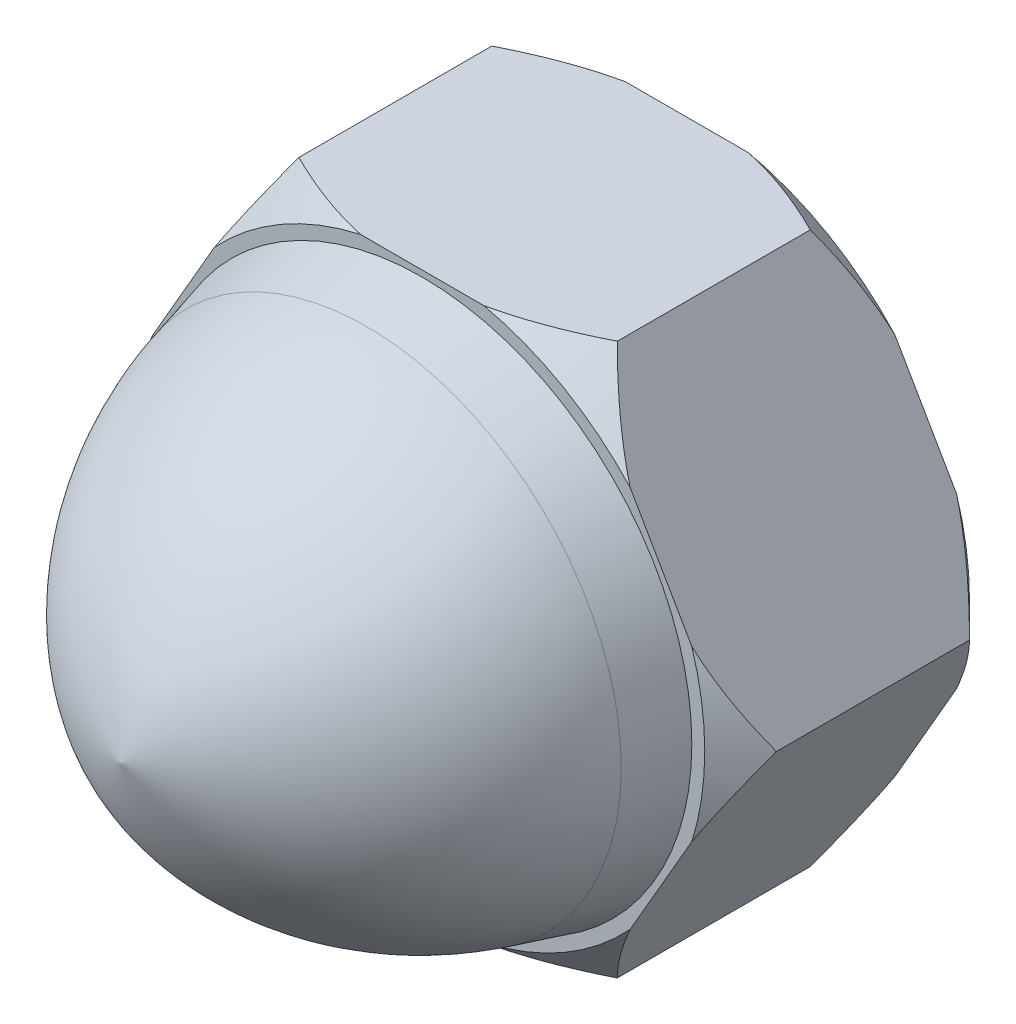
ISO-10303-21;
HEADER;
FILE_DESCRIPTION(('STEP AP214'),'2;1');
FILE_NAME('part.step','',(''),(''),'','','');
FILE_SCHEMA(('AUTOMOTIVE_DESIGN { 1 0 10303 214 1 1 1 1 }'));
ENDSEC;
DATA;
#1=APPLICATION_CONTEXT('core data for automotive mechanical design processes');
#2=APPLICATION_PROTOCOL_DEFINITION('international standard','automotive_design',2000,#1);
#3=PRODUCT_CONTEXT('',#1,'mechanical');
#4=PRODUCT('Part','Part','',(#3));
#5=PRODUCT_RELATED_PRODUCT_CATEGORY('part','',(#4));
#6=PRODUCT_DEFINITION_FORMATION('','',#4);
#7=PRODUCT_DEFINITION_CONTEXT('part definition',#1,'design');
#8=PRODUCT_DEFINITION('design','',#6,#7);
#9=PRODUCT_DEFINITION_SHAPE('','',#8);
#10=(LENGTH_UNIT() NAMED_UNIT(*) SI_UNIT(.MILLI.,.METRE.));
#11=(NAMED_UNIT(*) PLANE_ANGLE_UNIT() SI_UNIT($,.RADIAN.));
#12=(NAMED_UNIT(*) SI_UNIT($,.STERADIAN.) SOLID_ANGLE_UNIT());
#13=UNCERTAINTY_MEASURE_WITH_UNIT(LENGTH_MEASURE(1.E-05),#10,'distance_accuracy_value','');
#14=(GEOMETRIC_REPRESENTATION_CONTEXT(3) GLOBAL_UNCERTAINTY_ASSIGNED_CONTEXT((#13)) GLOBAL_UNIT_ASSIGNED_CONTEXT((#10,
#11,#12)) REPRESENTATION_CONTEXT('',''));
#15=CARTESIAN_POINT('',(0.,0.,0.));
#16=DIRECTION('',(0.,0.,1.));
#17=DIRECTION('',(1.,0.,0.));
#18=AXIS2_PLACEMENT_3D('',#15,#16,#17);
#19=CARTESIAN_POINT('',(-2.88675134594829,4.99999999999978,-4.79999999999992));
#20=DIRECTION('',(-0.866025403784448,0.50000000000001,0.));
#21=DIRECTION('',(-0.500000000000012,-0.86602540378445,0.));
#22=AXIS2_PLACEMENT_3D('',#19,#20,#21);
#23=PLANE('',#22);
#24=DIRECTION('',(-0.500000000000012,-0.86602540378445,0.));
#25=VECTOR('',#24,1.);
#26=CARTESIAN_POINT('',(-2.88675134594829,4.99999999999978,-4.79999999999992));
#27=LINE('',#26,#25);
#28=CARTESIAN_POINT('',(-3.77104745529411,3.46835420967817,-4.79999999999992));
#29=VERTEX_POINT('',#28);
#30=CARTESIAN_POINT('',(-4.88920658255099,1.53164579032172,-4.79999999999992));
#31=VERTEX_POINT('',#30);
#32=EDGE_CURVE('E310',#29,#31,#27,.T.);
#33=ORIENTED_EDGE('',*,*,#32,.T.);
#34=CARTESIAN_POINT('',(-4.88874819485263,1.53243974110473,-4.80020000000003));
#35=CARTESIAN_POINT('',(-4.96592278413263,1.39876943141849,-4.76656010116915));
#36=CARTESIAN_POINT('',(-5.04233841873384,1.26641366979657,-4.72656794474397));
#37=CARTESIAN_POINT('',(-5.19324849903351,1.00502974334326,-4.63584426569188));
#38=CARTESIAN_POINT('',(-5.26774920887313,0.87599072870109,-4.58515468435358));
#39=CARTESIAN_POINT('',(-5.41496552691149,0.621004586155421,-4.4747570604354));
#40=CARTESIAN_POINT('',(-5.48768246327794,0.495055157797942,-4.41505598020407));
#41=CARTESIAN_POINT('',(-5.63174169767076,0.245537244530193,-4.28788948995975));
#42=CARTESIAN_POINT('',(-5.70307760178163,0.12197983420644,-4.2203949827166));
#43=CARTESIAN_POINT('',(-5.77361816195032,-0.000199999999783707,-4.14988452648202));
#44=B_SPLINE_CURVE_WITH_KNOTS('',3,(#34,#35,#36,#37,#38,#39,#40,#41,#42,#43),.UNSPECIFIED.,.F.,
.F.,(4,2,2,2,4),(0.,0.473596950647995,0.945370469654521,1.41678134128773,1.89001292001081),.UNSPECIFIED.);
#45=CARTESIAN_POINT('',(-5.77350269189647,2.22044604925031E-13,-4.1500000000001));
#46=VERTEX_POINT('',#45);
#47=EDGE_CURVE('E190',#31,#46,#44,.T.);
#48=ORIENTED_EDGE('',*,*,#47,.T.);
#49=DIRECTION('',(0.,0.,1.));
#50=VECTOR('',#49,1.);
#51=CARTESIAN_POINT('',(-5.77350269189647,2.22044604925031E-13,-4.79999999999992));
#52=LINE('',#51,#50);
#53=CARTESIAN_POINT('',(-5.77350269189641,0.,-0.650000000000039));
#54=VERTEX_POINT('',#53);
#55=EDGE_CURVE('E328',#46,#54,#52,.T.);
#56=ORIENTED_EDGE('',*,*,#55,.T.);
#57=CARTESIAN_POINT('',(-4.88874819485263,1.53243974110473,0.000200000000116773));
#58=CARTESIAN_POINT('',(-4.96592278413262,1.3987694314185,-0.0334398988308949));
#59=CARTESIAN_POINT('',(-5.04233841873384,1.26641366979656,-0.0734320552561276));
#60=CARTESIAN_POINT('',(-5.19324849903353,1.00502974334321,-0.164155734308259));
#61=CARTESIAN_POINT('',(-5.26774920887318,0.875990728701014,-0.214845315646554));
#62=CARTESIAN_POINT('',(-5.41496552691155,0.621004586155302,-0.325242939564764));
#63=CARTESIAN_POINT('',(-5.48768246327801,0.495055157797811,-0.384944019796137));
#64=CARTESIAN_POINT('',(-5.63174169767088,0.24553724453,-0.512110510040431));
#65=CARTESIAN_POINT('',(-5.70307760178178,0.1219798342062,-0.579605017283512));
#66=CARTESIAN_POINT('',(-5.77361816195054,-0.000200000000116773,-0.650115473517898));
#67=B_SPLINE_CURVE_WITH_KNOTS('',3,(#57,#58,#59,#60,#61,#62,#63,#64,#65,#66),.UNSPECIFIED.,.F.,
.F.,(4,2,2,2,4),(0.,0.473596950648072,0.945370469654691,1.41678134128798,1.89001292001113),.UNSPECIFIED.);
#68=CARTESIAN_POINT('',(-4.88920658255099,1.53164579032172,0.));
#69=VERTEX_POINT('',#68);
#70=EDGE_CURVE('E273',#69,#54,#67,.T.);
#71=ORIENTED_EDGE('',*,*,#70,.F.);
#72=DIRECTION('',(-0.500000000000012,-0.86602540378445,0.));
#73=VECTOR('',#72,1.);
#74=CARTESIAN_POINT('',(-2.88675134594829,4.99999999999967,0.));
#75=LINE('',#74,#73);
#76=CARTESIAN_POINT('',(-3.77104745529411,3.46835420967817,0.));
#77=VERTEX_POINT('',#76);
#78=EDGE_CURVE('E286',#77,#69,#75,.T.);
#79=ORIENTED_EDGE('',*,*,#78,.F.);
#80=CARTESIAN_POINT('',(-2.88663587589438,5.00019999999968,-0.650115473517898));
#81=CARTESIAN_POINT('',(-2.95717643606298,4.87802016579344,-0.579605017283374));
#82=CARTESIAN_POINT('',(-3.02851234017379,4.75446275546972,-0.512110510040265));
#83=CARTESIAN_POINT('',(-3.17257157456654,4.50494484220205,-0.384944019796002));
#84=CARTESIAN_POINT('',(-3.24528851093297,4.37899541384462,-0.325242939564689));
#85=CARTESIAN_POINT('',(-3.39250482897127,4.12400927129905,-0.214845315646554));
#86=CARTESIAN_POINT('',(-3.46700553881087,3.99497025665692,-0.164155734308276));
#87=CARTESIAN_POINT('',(-3.61791561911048,3.73358633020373,-0.0734320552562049));
#88=CARTESIAN_POINT('',(-3.69433125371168,3.60123056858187,-0.0334398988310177));
#89=CARTESIAN_POINT('',(-3.77150584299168,3.46756025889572,0.000199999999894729));
#90=B_SPLINE_CURVE_WITH_KNOTS('',3,(#80,#81,#82,#83,#84,#85,#86,#87,#88,#89),.UNSPECIFIED.,.F.,
.F.,(4,2,2,2,4),(0.,0.473231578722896,0.944642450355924,1.41641596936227,1.89001292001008),.UNSPECIFIED.);
#91=CARTESIAN_POINT('',(-2.88675134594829,4.99999999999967,-0.650000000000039));
#92=VERTEX_POINT('',#91);
#93=EDGE_CURVE('E280',#92,#77,#90,.T.);
#94=ORIENTED_EDGE('',*,*,#93,.F.);
#95=DIRECTION('',(0.,0.,1.));
#96=VECTOR('',#95,1.);
#97=CARTESIAN_POINT('',(-2.88675134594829,4.99999999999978,-4.79999999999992));
#98=LINE('',#97,#96);
#99=CARTESIAN_POINT('',(-2.88675134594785,5.00000000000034,-4.14999999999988));
#100=VERTEX_POINT('',#99);
#101=EDGE_CURVE('E338',#100,#92,#98,.T.);
#102=ORIENTED_EDGE('',*,*,#101,.F.);
#103=CARTESIAN_POINT('',(-2.88663587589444,5.00019999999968,-4.14988452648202));
#104=CARTESIAN_POINT('',(-2.95717643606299,4.87802016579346,-4.22039498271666));
#105=CARTESIAN_POINT('',(-3.02851234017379,4.75446275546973,-4.28788948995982));
#106=CARTESIAN_POINT('',(-3.17257157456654,4.50494484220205,-4.41505598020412));
#107=CARTESIAN_POINT('',(-3.24528851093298,4.37899541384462,-4.47475706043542));
#108=CARTESIAN_POINT('',(-3.39250482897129,4.12400927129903,-4.58515468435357));
#109=CARTESIAN_POINT('',(-3.46700553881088,3.99497025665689,-4.63584426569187));
#110=CARTESIAN_POINT('',(-3.61791561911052,3.73358633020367,-4.72656794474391));
#111=CARTESIAN_POINT('',(-3.69433125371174,3.60123056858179,-4.76656010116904));
#112=CARTESIAN_POINT('',(-3.7715058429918,3.46756025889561,-4.80019999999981));
#113=B_SPLINE_CURVE_WITH_KNOTS('',3,(#103,#104,#105,#106,#107,#108,#109,#110,#111,#112),
.UNSPECIFIED.,.F.,.F.,(4,2,2,2,4),(0.,0.47323157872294,0.944642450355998,1.41641596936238,
1.89001292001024),.UNSPECIFIED.);
#114=EDGE_CURVE('E257',#100,#29,#113,.T.);
#115=ORIENTED_EDGE('',*,*,#114,.T.);
#116=EDGE_LOOP('',(#33,#48,#56,#71,#79,#94,#102,#115));
#117=FACE_BOUND('',#116,.T.);
#118=ADVANCED_FACE('F36',(#117),#23,.T.);
#119=CARTESIAN_POINT('',(-2.88675134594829,4.99999999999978,-4.79999999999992));
#120=DIRECTION('',(0.,-1.00000000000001,0.));
#121=DIRECTION('',(0.,0.,-1.));
#122=AXIS2_PLACEMENT_3D('',#119,#120,#121);
#123=PLANE('',#122);
#124=CARTESIAN_POINT('',(-6.0743844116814,5.00000000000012,-2.05596521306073));
#125=CARTESIAN_POINT('',(-5.92696145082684,4.9999999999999,-2.16976184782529));
#126=CARTESIAN_POINT('',(-5.77874546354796,4.99999999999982,-2.28254741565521));
#127=CARTESIAN_POINT('',(-5.48039825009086,4.99999999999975,-2.50562942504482));
#128=CARTESIAN_POINT('',(-5.33026657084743,4.99999999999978,-2.6159252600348));
#129=CARTESIAN_POINT('',(-5.02665578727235,4.99999999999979,-2.83434992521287));
#130=CARTESIAN_POINT('',(-4.87315974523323,4.99999999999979,-2.94245528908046));
#131=CARTESIAN_POINT('',(-4.56360196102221,4.99999999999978,-3.15491477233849));
#132=CARTESIAN_POINT('',(-4.40754040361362,4.99999999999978,-3.2592691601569));
#133=CARTESIAN_POINT('',(-4.08414142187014,4.99999999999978,-3.46871874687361));
#134=CARTESIAN_POINT('',(-3.91664213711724,4.99999999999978,-3.57356525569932));
#135=CARTESIAN_POINT('',(-3.57772064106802,4.99999999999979,-3.77682164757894));
#136=CARTESIAN_POINT('',(-3.40629777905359,4.99999999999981,-3.87523045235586));
#137=CARTESIAN_POINT('',(-3.05948252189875,4.99999999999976,-4.06352927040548));
#138=CARTESIAN_POINT('',(-2.88410393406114,4.99999999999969,-4.15344451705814));
#139=CARTESIAN_POINT('',(-2.52838393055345,4.99999999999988,-4.32276384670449));
#140=CARTESIAN_POINT('',(-2.3480448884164,5.00000000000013,-4.40217285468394));
#141=CARTESIAN_POINT('',(-2.00029356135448,5.0000000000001,-4.54034900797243));
#142=CARTESIAN_POINT('',(-1.83339100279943,4.99999999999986,-4.60038604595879));
#143=CARTESIAN_POINT('',(-1.49528198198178,4.9999999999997,-4.70716660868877));
#144=CARTESIAN_POINT('',(-1.32407466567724,4.99999999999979,-4.75390747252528));
#145=CARTESIAN_POINT('',(-0.98019982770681,4.99999999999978,-4.83104764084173));
#146=CARTESIAN_POINT('',(-0.807577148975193,4.99999999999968,-4.8616434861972));
#147=CARTESIAN_POINT('',(-0.460193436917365,4.99999999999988,-4.90532012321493));
#148=CARTESIAN_POINT('',(-0.28543395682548,5.00000000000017,-4.91841295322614));
#149=CARTESIAN_POINT('',(0.0379073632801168,5.00000000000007,-4.92556401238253));
#150=CARTESIAN_POINT('',(0.186436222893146,4.99999999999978,-4.92220983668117));
#151=CARTESIAN_POINT('',(0.482686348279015,4.99999999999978,-4.90243429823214));
#152=CARTESIAN_POINT('',(0.630407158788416,5.00000000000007,-4.88600620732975));
#153=CARTESIAN_POINT('',(0.954897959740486,5.00000000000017,-4.83616531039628));
#154=CARTESIAN_POINT('',(1.13122800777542,4.99999999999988,-4.79990234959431));
#155=CARTESIAN_POINT('',(1.4799895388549,4.99999999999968,-4.71180153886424));
#156=CARTESIAN_POINT('',(1.6524187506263,4.99999999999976,-4.65995485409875));
#157=CARTESIAN_POINT('',(1.90866762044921,4.99999999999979,-4.57219755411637));
#158=CARTESIAN_POINT('',(1.99417169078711,4.99999999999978,-4.54107119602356));
#159=CARTESIAN_POINT('',(2.16400740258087,4.99999999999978,-4.47586247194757));
#160=CARTESIAN_POINT('',(2.24833952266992,4.99999999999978,-4.44178135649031));
#161=CARTESIAN_POINT('',(2.41585326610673,4.99999999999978,-4.37097306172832));
#162=CARTESIAN_POINT('',(2.49903519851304,4.99999999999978,-4.3342466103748));
#163=CARTESIAN_POINT('',(2.66431680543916,4.99999999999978,-4.2584172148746));
#164=CARTESIAN_POINT('',(2.74641635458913,4.99999999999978,-4.21931399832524));
#165=CARTESIAN_POINT('',(2.9688423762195,4.99999999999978,-4.10981357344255));
#166=CARTESIAN_POINT('',(3.10813882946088,4.99999999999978,-4.03731985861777));
#167=CARTESIAN_POINT('',(3.3839221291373,4.99999999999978,-3.88714991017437));
#168=CARTESIAN_POINT('',(3.52040842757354,4.99999999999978,-3.80947267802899));
#169=CARTESIAN_POINT('',(3.79094025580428,4.99999999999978,-3.64980411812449));
#170=CARTESIAN_POINT('',(3.92498421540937,4.99999999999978,-3.56781013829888));
#171=CARTESIAN_POINT('',(4.19084110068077,4.99999999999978,-3.40027368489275));
#172=CARTESIAN_POINT('',(4.32265385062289,4.99999999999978,-3.31473093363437));
#173=CARTESIAN_POINT('',(4.71624436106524,4.99999999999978,-3.05296339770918));
#174=CARTESIAN_POINT('',(4.97505329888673,4.99999999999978,-2.87227415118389));
#175=CARTESIAN_POINT('',(5.48645942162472,4.99999999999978,-2.50257699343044));
#176=CARTESIAN_POINT('',(5.73905869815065,4.99999999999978,-2.31357194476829));
#177=CARTESIAN_POINT('',(6.22089023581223,4.99999999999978,-1.94368581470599));
#178=CARTESIAN_POINT('',(6.45046281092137,4.99999999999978,-1.76324647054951));
#179=CARTESIAN_POINT('',(6.90636974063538,4.99999999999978,-1.39828691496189));
#180=CARTESIAN_POINT('',(7.13270376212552,4.99999999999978,-1.21376628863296));
#181=CARTESIAN_POINT('',(7.58057613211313,4.99999999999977,-0.843337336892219));
#182=CARTESIAN_POINT('',(7.80213966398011,4.99999999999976,-0.657459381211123));
#183=CARTESIAN_POINT('',(8.24308149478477,4.99999999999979,-0.283221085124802));
#184=CARTESIAN_POINT('',(8.46246024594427,4.99999999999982,-0.0948612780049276));
#185=CARTESIAN_POINT('',(8.68099230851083,4.99999999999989,0.0944625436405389));
#186=B_SPLINE_CURVE_WITH_KNOTS('',3,(#124,#125,#126,#127,#128,#129,#130,#131,#132,#133,#134,
#135,#136,#137,#138,#139,#140,#141,#142,#143,#144,#145,#146,#147,#148,#149,#150,#151,#152,#153,
#154,#155,#156,#157,#158,#159,#160,#161,#162,#163,#164,#165,#166,#167,#168,#169,#170,#171,#172,
#173,#174,#175,#176,#177,#178,#179,#180,#181,#182,#183,#184,#185),.UNSPECIFIED.,.F.,.F.,(4,2,2,
2,2,2,2,2,2,2,2,2,2,2,2,2,2,2,2,2,2,2,2,2,2,2,2,2,2,2,4),(0.,0.558713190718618,1.11756106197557,
1.68074683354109,2.24389222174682,2.83660031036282,3.4294074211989,4.02039400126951,
4.61110255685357,5.14276549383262,5.67453475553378,6.1996718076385,6.72444749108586,
7.16956766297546,7.61491705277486,8.1541366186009,8.69366246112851,8.96659806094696,
9.23941870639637,9.51216456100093,9.78494173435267,10.2558895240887,10.7269282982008,
11.198259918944,11.6696284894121,12.6162870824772,13.5626223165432,14.4385526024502,
15.3145723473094,16.1821747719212,17.0495937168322),.UNSPECIFIED.);
#187=CARTESIAN_POINT('',(-1.11815912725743,4.99999999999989,-4.79999999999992));
#188=VERTEX_POINT('',#187);
#189=EDGE_CURVE('E256',#100,#188,#186,.T.);
#190=ORIENTED_EDGE('',*,*,#189,.F.);
#191=ORIENTED_EDGE('',*,*,#101,.T.);
#192=CARTESIAN_POINT('',(-6.07438441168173,5.,-2.74403478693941));
#193=CARTESIAN_POINT('',(-5.9269614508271,4.99999999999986,-2.63023815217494));
#194=CARTESIAN_POINT('',(-5.77874546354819,4.9999999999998,-2.51745258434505));
#195=CARTESIAN_POINT('',(-5.48039825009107,4.99999999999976,-2.29437057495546));
#196=CARTESIAN_POINT('',(-5.33026657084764,4.99999999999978,-2.18407473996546));
#197=CARTESIAN_POINT('',(-5.02665578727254,4.99999999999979,-1.96565007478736));
#198=CARTESIAN_POINT('',(-4.8731597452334,4.99999999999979,-1.85754471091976));
#199=CARTESIAN_POINT('',(-4.56360196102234,4.99999999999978,-1.6450852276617));
#200=CARTESIAN_POINT('',(-4.40754040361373,4.99999999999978,-1.54073083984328));
#201=CARTESIAN_POINT('',(-4.08414142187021,4.99999999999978,-1.33128125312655));
#202=CARTESIAN_POINT('',(-3.91664213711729,4.99999999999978,-1.22643474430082));
#203=CARTESIAN_POINT('',(-3.57772064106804,4.99999999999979,-1.02317835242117));
#204=CARTESIAN_POINT('',(-3.40629777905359,4.9999999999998,-0.924769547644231));
#205=CARTESIAN_POINT('',(-3.05948252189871,4.99999999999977,-0.736470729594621));
#206=CARTESIAN_POINT('',(-2.88410393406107,4.99999999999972,-0.646555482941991));
#207=CARTESIAN_POINT('',(-2.52838393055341,4.99999999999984,-0.477236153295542));
#208=CARTESIAN_POINT('',(-2.34804488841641,5.00000000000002,-0.397827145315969));
#209=CARTESIAN_POINT('',(-2.00029356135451,4.99999999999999,-0.259650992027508));
#210=CARTESIAN_POINT('',(-1.83339100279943,4.99999999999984,-0.19961395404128));
#211=CARTESIAN_POINT('',(-1.4952819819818,4.99999999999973,-0.0928333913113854));
#212=CARTESIAN_POINT('',(-1.32407466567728,4.99999999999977,-0.0460925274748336));
#213=CARTESIAN_POINT('',(-0.980199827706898,4.99999999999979,0.0310476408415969));
#214=CARTESIAN_POINT('',(-0.807577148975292,4.99999999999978,0.0616434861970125));
#215=CARTESIAN_POINT('',(-0.460193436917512,4.99999999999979,0.105320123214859));
#216=CARTESIAN_POINT('',(-0.285433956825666,4.99999999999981,0.118412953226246));
#217=CARTESIAN_POINT('',(0.0379073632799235,4.99999999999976,0.1255640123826));
#218=CARTESIAN_POINT('',(0.186436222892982,4.9999999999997,0.122209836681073));
#219=CARTESIAN_POINT('',(0.482686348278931,4.99999999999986,0.102434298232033));
#220=CARTESIAN_POINT('',(0.630407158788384,5.00000000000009,0.0860062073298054));
#221=CARTESIAN_POINT('',(0.954897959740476,5.00000000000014,0.0361653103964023));
#222=CARTESIAN_POINT('',(1.13122800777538,4.99999999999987,-9.76504057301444E-05));
#223=CARTESIAN_POINT('',(1.47998953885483,4.99999999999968,-0.088198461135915));
#224=CARTESIAN_POINT('',(1.65241875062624,4.99999999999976,-0.14004514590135));
#225=CARTESIAN_POINT('',(1.90866762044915,4.99999999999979,-0.227802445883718));
#226=CARTESIAN_POINT('',(1.99417169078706,4.99999999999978,-0.258928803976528));
#227=CARTESIAN_POINT('',(2.16400740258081,4.99999999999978,-0.324137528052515));
#228=CARTESIAN_POINT('',(2.24833952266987,4.99999999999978,-0.35821864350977));
#229=CARTESIAN_POINT('',(2.41585326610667,4.99999999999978,-0.429026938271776));
#230=CARTESIAN_POINT('',(2.49903519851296,4.99999999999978,-0.465753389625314));
#231=CARTESIAN_POINT('',(2.66431680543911,4.99999999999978,-0.541582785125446));
#232=CARTESIAN_POINT('',(2.74641635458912,4.99999999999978,-0.580686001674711));
#233=CARTESIAN_POINT('',(2.96884237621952,4.99999999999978,-0.690186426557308));
#234=CARTESIAN_POINT('',(3.10813882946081,4.99999999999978,-0.762680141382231));
#235=CARTESIAN_POINT('',(3.38392212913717,4.99999999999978,-0.912850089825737));
#236=CARTESIAN_POINT('',(3.52040842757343,4.99999999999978,-0.990527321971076));
#237=CARTESIAN_POINT('',(3.79094025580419,4.99999999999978,-1.15019588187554));
#238=CARTESIAN_POINT('',(3.92498421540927,4.99999999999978,-1.23218986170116));
#239=CARTESIAN_POINT('',(4.19084110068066,4.99999999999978,-1.39972631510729));
#240=CARTESIAN_POINT('',(4.32265385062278,4.99999999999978,-1.48526906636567));
#241=CARTESIAN_POINT('',(4.71624436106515,4.99999999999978,-1.74703660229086));
#242=CARTESIAN_POINT('',(4.97505329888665,4.99999999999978,-1.92772584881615));
#243=CARTESIAN_POINT('',(5.48645942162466,4.99999999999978,-2.29742300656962));
#244=CARTESIAN_POINT('',(5.7390586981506,4.99999999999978,-2.48642805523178));
#245=CARTESIAN_POINT('',(6.22089023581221,4.99999999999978,-2.8563141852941));
#246=CARTESIAN_POINT('',(6.45046281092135,4.99999999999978,-3.03675352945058));
#247=CARTESIAN_POINT('',(6.9063697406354,4.99999999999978,-3.40171308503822));
#248=CARTESIAN_POINT('',(7.13270376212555,4.99999999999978,-3.58623371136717));
#249=CARTESIAN_POINT('',(7.58057613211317,4.99999999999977,-3.95666266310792));
#250=CARTESIAN_POINT('',(7.80213966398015,4.99999999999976,-4.14254061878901));
#251=CARTESIAN_POINT('',(8.2430814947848,4.99999999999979,-4.51677891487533));
#252=CARTESIAN_POINT('',(8.46246024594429,4.99999999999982,-4.7051387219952));
#253=CARTESIAN_POINT('',(8.68099230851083,4.99999999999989,-4.89446254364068));
#254=B_SPLINE_CURVE_WITH_KNOTS('',3,(#192,#193,#194,#195,#196,#197,#198,#199,#200,#201,#202,
#203,#204,#205,#206,#207,#208,#209,#210,#211,#212,#213,#214,#215,#216,#217,#218,#219,#220,#221,
#222,#223,#224,#225,#226,#227,#228,#229,#230,#231,#232,#233,#234,#235,#236,#237,#238,#239,#240,
#241,#242,#243,#244,#245,#246,#247,#248,#249,#250,#251,#252,#253),.UNSPECIFIED.,.F.,.F.,(4,2,2,
2,2,2,2,2,2,2,2,2,2,2,2,2,2,2,2,2,2,2,2,2,2,2,2,2,2,2,4),(0.,0.558713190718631,1.1175610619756,
1.6807468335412,2.243892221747,2.83660031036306,3.42940742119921,4.02039400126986,
4.61110255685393,5.1427654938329,5.674534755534,6.19967180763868,6.72444749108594,
7.16956766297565,7.61491705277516,8.15413661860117,8.69366246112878,8.96659806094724,
9.23941870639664,9.5121645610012,9.78494173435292,10.2558895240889,10.726928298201,
11.1982599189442,11.6696284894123,12.6162870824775,13.5626223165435,14.4385526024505,
15.3145723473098,16.1821747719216,17.0495937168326),.UNSPECIFIED.);
#255=CARTESIAN_POINT('',(-1.11815912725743,4.99999999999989,0.));
#256=VERTEX_POINT('',#255);
#257=EDGE_CURVE('E287',#92,#256,#254,.T.);
#258=ORIENTED_EDGE('',*,*,#257,.T.);
#259=DIRECTION('',(1.00000000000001,0.,0.));
#260=VECTOR('',#259,1.);
#261=CARTESIAN_POINT('',(-2.88675134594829,4.99999999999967,0.));
#262=LINE('',#261,#260);
#263=CARTESIAN_POINT('',(1.11815912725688,5.,0.));
#264=VERTEX_POINT('',#263);
#265=EDGE_CURVE('E307',#256,#264,#262,.T.);
#266=ORIENTED_EDGE('',*,*,#265,.T.);
#267=CARTESIAN_POINT('',(2.88675134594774,4.99999999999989,-0.650000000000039));
#268=VERTEX_POINT('',#267);
#269=EDGE_CURVE('E288',#264,#268,#254,.T.);
#270=ORIENTED_EDGE('',*,*,#269,.T.);
#271=DIRECTION('',(0.,0.,1.));
#272=VECTOR('',#271,1.);
#273=CARTESIAN_POINT('',(2.88675134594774,5.00000000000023,-4.79999999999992));
#274=LINE('',#273,#272);
#275=CARTESIAN_POINT('',(2.88675134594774,5.00000000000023,-4.14999999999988));
#276=VERTEX_POINT('',#275);
#277=EDGE_CURVE('E336',#276,#268,#274,.T.);
#278=ORIENTED_EDGE('',*,*,#277,.F.);
#279=CARTESIAN_POINT('',(1.11815912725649,4.99999999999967,-4.79999999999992));
#280=VERTEX_POINT('',#279);
#281=EDGE_CURVE('E252',#280,#276,#186,.T.);
#282=ORIENTED_EDGE('',*,*,#281,.F.);
#283=DIRECTION('',(1.00000000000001,0.,0.));
#284=VECTOR('',#283,1.);
#285=CARTESIAN_POINT('',(-2.88675134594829,4.99999999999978,-4.79999999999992));
#286=LINE('',#285,#284);
#287=EDGE_CURVE('E325',#188,#280,#286,.T.);
#288=ORIENTED_EDGE('',*,*,#287,.F.);
#289=EDGE_LOOP('',(#190,#191,#258,#266,#270,#278,#282,#288));
#290=FACE_BOUND('',#289,.T.);
#291=ADVANCED_FACE('F38',(#290),#123,.F.);
#292=CARTESIAN_POINT('',(2.88675134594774,5.00000000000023,-4.79999999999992));
#293=DIRECTION('',(-0.866025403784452,-0.500000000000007,0.));
#294=DIRECTION('',(0.500000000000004,-0.866025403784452,0.));
#295=AXIS2_PLACEMENT_3D('',#292,#293,#294);
#296=PLANE('',#295);
#297=CARTESIAN_POINT('',(4.8887481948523,1.53243974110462,-4.80020000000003));
#298=CARTESIAN_POINT('',(4.96592278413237,1.39876943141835,-4.76656010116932));
#299=CARTESIAN_POINT('',(5.04233841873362,1.2664136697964,-4.7265679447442));
#300=CARTESIAN_POINT('',(5.1932484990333,1.00502974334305,-4.63584426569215));
#301=CARTESIAN_POINT('',(5.26774920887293,0.875990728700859,-4.58515468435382));
#302=CARTESIAN_POINT('',(5.41496552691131,0.621004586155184,-4.47475706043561));
#303=CARTESIAN_POINT('',(5.48768246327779,0.495055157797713,-4.41505598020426));
#304=CARTESIAN_POINT('',(5.63174169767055,0.245537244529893,-4.28788948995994));
#305=CARTESIAN_POINT('',(5.70307760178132,0.121979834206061,-4.2203949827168));
#306=CARTESIAN_POINT('',(5.77361816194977,-0.000200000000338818,-4.14988452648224));
#307=B_SPLINE_CURVE_WITH_KNOTS('',3,(#297,#298,#299,#300,#301,#302,#303,#304,#305,#306),
.UNSPECIFIED.,.F.,.F.,(4,2,2,2,4),(0.,0.47359695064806,0.945370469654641,1.41678134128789,
1.89001292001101),.UNSPECIFIED.);
#308=CARTESIAN_POINT('',(4.88920658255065,1.53164579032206,-4.79999999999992));
#309=VERTEX_POINT('',#308);
#310=CARTESIAN_POINT('',(5.77350269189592,1.11022302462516E-13,-4.1500000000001));
#311=VERTEX_POINT('',#310);
#312=EDGE_CURVE('E242',#309,#311,#307,.T.);
#313=ORIENTED_EDGE('',*,*,#312,.F.);
#314=DIRECTION('',(0.500000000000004,-0.866025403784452,0.));
#315=VECTOR('',#314,1.);
#316=CARTESIAN_POINT('',(2.88675134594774,5.00000000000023,-4.79999999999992));
#317=LINE('',#316,#315);
#318=CARTESIAN_POINT('',(3.77104745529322,3.46835420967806,-4.79999999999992));
#319=VERTEX_POINT('',#318);
#320=EDGE_CURVE('E322',#319,#309,#317,.T.);
#321=ORIENTED_EDGE('',*,*,#320,.F.);
#322=CARTESIAN_POINT('',(2.88663587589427,5.00020000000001,-4.14988452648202));
#323=CARTESIAN_POINT('',(2.95717643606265,4.8780201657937,-4.2203949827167));
#324=CARTESIAN_POINT('',(3.02851234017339,4.75446275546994,-4.28788948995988));
#325=CARTESIAN_POINT('',(3.17257157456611,4.50494484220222,-4.4150559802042));
#326=CARTESIAN_POINT('',(3.24528851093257,4.37899541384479,-4.47475706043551));
#327=CARTESIAN_POINT('',(3.39250482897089,4.1240092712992,-4.5851546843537));
#328=CARTESIAN_POINT('',(3.46700553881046,3.99497025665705,-4.63584426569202));
#329=CARTESIAN_POINT('',(3.61791561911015,3.73358633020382,-4.72656794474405));
#330=CARTESIAN_POINT('',(3.69433125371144,3.60123056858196,-4.76656010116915));
#331=CARTESIAN_POINT('',(3.77150584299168,3.46756025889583,-4.80019999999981));
#332=B_SPLINE_CURVE_WITH_KNOTS('',3,(#322,#323,#324,#325,#326,#327,#328,#329,#330,#331),
.UNSPECIFIED.,.F.,.F.,(4,2,2,2,4),(0.,0.473231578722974,0.94464245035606,1.41641596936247,
1.89001292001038),.UNSPECIFIED.);
#333=EDGE_CURVE('E247',#276,#319,#332,.T.);
#334=ORIENTED_EDGE('',*,*,#333,.F.);
#335=ORIENTED_EDGE('',*,*,#277,.T.);
#336=CARTESIAN_POINT('',(2.88663587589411,5.00019999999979,-0.650115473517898));
#337=CARTESIAN_POINT('',(2.95717643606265,4.87802016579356,-0.579605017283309));
#338=CARTESIAN_POINT('',(3.02851234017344,4.75446275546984,-0.512110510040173));
#339=CARTESIAN_POINT('',(3.17257157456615,4.50494484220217,-0.384944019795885));
#340=CARTESIAN_POINT('',(3.24528851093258,4.37899541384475,-0.325242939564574));
#341=CARTESIAN_POINT('',(3.3925048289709,4.1240092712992,-0.214845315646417));
#342=CARTESIAN_POINT('',(3.46700553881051,3.9949702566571,-0.164155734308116));
#343=CARTESIAN_POINT('',(3.61791561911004,3.73358633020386,-0.0734320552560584));
#344=CARTESIAN_POINT('',(3.69433125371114,3.60123056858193,-0.0334398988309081));
#345=CARTESIAN_POINT('',(3.77150584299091,3.46756025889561,0.000199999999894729));
#346=B_SPLINE_CURVE_WITH_KNOTS('',3,(#336,#337,#338,#339,#340,#341,#342,#343,#344,#345),
.UNSPECIFIED.,.F.,.F.,(4,2,2,2,4),(0.,0.47323157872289,0.944642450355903,1.41641596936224,
1.89001292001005),.UNSPECIFIED.);
#347=CARTESIAN_POINT('',(3.77104745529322,3.46835420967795,0.));
#348=VERTEX_POINT('',#347);
#349=EDGE_CURVE('E413',#268,#348,#346,.T.);
#350=ORIENTED_EDGE('',*,*,#349,.T.);
#351=DIRECTION('',(0.500000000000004,-0.866025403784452,0.));
#352=VECTOR('',#351,1.);
#353=CARTESIAN_POINT('',(2.88675134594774,4.99999999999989,0.));
#354=LINE('',#353,#352);
#355=CARTESIAN_POINT('',(4.88920658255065,1.53164579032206,0.));
#356=VERTEX_POINT('',#355);
#357=EDGE_CURVE('E304',#348,#356,#354,.T.);
#358=ORIENTED_EDGE('',*,*,#357,.T.);
#359=CARTESIAN_POINT('',(4.8887481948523,1.53243974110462,0.000199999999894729));
#360=CARTESIAN_POINT('',(4.96592278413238,1.39876943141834,-0.0334398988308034));
#361=CARTESIAN_POINT('',(5.04233841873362,1.26641366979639,-0.0734320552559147));
#362=CARTESIAN_POINT('',(5.19324849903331,1.00502974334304,-0.164155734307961));
#363=CARTESIAN_POINT('',(5.26774920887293,0.875990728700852,-0.214845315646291));
#364=CARTESIAN_POINT('',(5.41496552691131,0.621004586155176,-0.325242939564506));
#365=CARTESIAN_POINT('',(5.4876824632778,0.495055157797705,-0.384944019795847));
#366=CARTESIAN_POINT('',(5.63174169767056,0.245537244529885,-0.512110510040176));
#367=CARTESIAN_POINT('',(5.70307760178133,0.121979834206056,-0.579605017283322));
#368=CARTESIAN_POINT('',(5.77361816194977,-0.000200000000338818,-0.650115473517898));
#369=B_SPLINE_CURVE_WITH_KNOTS('',3,(#359,#360,#361,#362,#363,#364,#365,#366,#367,#368),
.UNSPECIFIED.,.F.,.F.,(4,2,2,2,4),(0.,0.473596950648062,0.945370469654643,1.41678134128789,
1.89001292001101),.UNSPECIFIED.);
#370=CARTESIAN_POINT('',(5.77350269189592,1.11022302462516E-13,-0.650000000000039));
#371=VERTEX_POINT('',#370);
#372=EDGE_CURVE('E385',#356,#371,#369,.T.);
#373=ORIENTED_EDGE('',*,*,#372,.T.);
#374=DIRECTION('',(0.,0.,1.));
#375=VECTOR('',#374,1.);
#376=CARTESIAN_POINT('',(5.77350269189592,1.11022302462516E-13,-4.79999999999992));
#377=LINE('',#376,#375);
#378=EDGE_CURVE('E334',#311,#371,#377,.T.);
#379=ORIENTED_EDGE('',*,*,#378,.F.);
#380=EDGE_LOOP('',(#313,#321,#334,#335,#350,#358,#373,#379));
#381=FACE_BOUND('',#380,.T.);
#382=ADVANCED_FACE('F399',(#381),#296,.F.);
#383=CARTESIAN_POINT('',(5.77350269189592,1.11022302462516E-13,-4.79999999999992));
#384=DIRECTION('',(-0.866025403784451,0.500000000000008,0.));
#385=DIRECTION('',(-0.50000000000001,-0.866025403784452,0.));
#386=AXIS2_PLACEMENT_3D('',#383,#384,#385);
#387=PLANE('',#386);
#388=CARTESIAN_POINT('',(3.77150584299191,-3.46756025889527,-4.80020000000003));
#389=CARTESIAN_POINT('',(3.69433125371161,-3.60123056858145,-4.76656010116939));
#390=CARTESIAN_POINT('',(3.61791561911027,-3.73358633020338,-4.72656794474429));
#391=CARTESIAN_POINT('',(3.4670055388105,-3.99497025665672,-4.63584426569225));
#392=CARTESIAN_POINT('',(3.3925048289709,-4.12400927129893,-4.58515468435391));
#393=CARTESIAN_POINT('',(3.24528851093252,-4.37899541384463,-4.47475706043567));
#394=CARTESIAN_POINT('',(3.17257157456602,-4.50494484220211,-4.41505598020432));
#395=CARTESIAN_POINT('',(3.02851234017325,-4.75446275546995,-4.28788948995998));
#396=CARTESIAN_POINT('',(2.95717643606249,-4.8780201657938,-4.22039498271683));
#397=CARTESIAN_POINT('',(2.88663587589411,-5.00020000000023,-4.14988452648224));
#398=B_SPLINE_CURVE_WITH_KNOTS('',3,(#388,#389,#390,#391,#392,#393,#394,#395,#396,#397),
.UNSPECIFIED.,.F.,.F.,(4,2,2,2,4),(0.,0.473596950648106,0.945370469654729,1.41678134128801,
1.89001292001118),.UNSPECIFIED.);
#399=CARTESIAN_POINT('',(3.77104745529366,-3.46835420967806,-4.79999999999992));
#400=VERTEX_POINT('',#399);
#401=CARTESIAN_POINT('',(2.8867513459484,-5.00000000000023,-4.1500000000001));
#402=VERTEX_POINT('',#401);
#403=EDGE_CURVE('E229',#400,#402,#398,.T.);
#404=ORIENTED_EDGE('',*,*,#403,.F.);
#405=DIRECTION('',(-0.500000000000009,-0.866025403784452,0.));
#406=VECTOR('',#405,1.);
#407=CARTESIAN_POINT('',(5.77350269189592,1.11022302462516E-13,-4.79999999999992));
#408=LINE('',#407,#406);
#409=CARTESIAN_POINT('',(4.88920658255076,-1.53164579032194,-4.79999999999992));
#410=VERTEX_POINT('',#409);
#411=EDGE_CURVE('E319',#410,#400,#408,.T.);
#412=ORIENTED_EDGE('',*,*,#411,.F.);
#413=CARTESIAN_POINT('',(5.7736181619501,0.000200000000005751,-4.14988452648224));
#414=CARTESIAN_POINT('',(5.70307760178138,-0.121979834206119,-4.22039498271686));
#415=CARTESIAN_POINT('',(5.63174169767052,-0.245537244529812,-4.28788948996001));
#416=CARTESIAN_POINT('',(5.48768246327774,-0.495055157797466,-4.41505598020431));
#417=CARTESIAN_POINT('',(5.41496552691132,-0.621004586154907,-4.47475706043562));
#418=CARTESIAN_POINT('',(5.26774920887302,-0.875990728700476,-4.5851546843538));
#419=CARTESIAN_POINT('',(5.1932484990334,-1.00502974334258,-4.63584426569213));
#420=CARTESIAN_POINT('',(5.04233841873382,-1.26641366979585,-4.72656794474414));
#421=CARTESIAN_POINT('',(4.96592278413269,-1.39876943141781,-4.76656010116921));
#422=CARTESIAN_POINT('',(4.88874819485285,-1.53243974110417,-4.80019999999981));
#423=B_SPLINE_CURVE_WITH_KNOTS('',3,(#413,#414,#415,#416,#417,#418,#419,#420,#421,#422),
.UNSPECIFIED.,.F.,.F.,(4,2,2,2,4),(0.,0.47323157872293,0.944642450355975,1.41641596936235,
1.89001292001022),.UNSPECIFIED.);
#424=EDGE_CURVE('E236',#311,#410,#423,.T.);
#425=ORIENTED_EDGE('',*,*,#424,.F.);
#426=ORIENTED_EDGE('',*,*,#378,.T.);
#427=CARTESIAN_POINT('',(5.77361816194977,0.000200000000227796,-0.650115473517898));
#428=CARTESIAN_POINT('',(5.70307760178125,-0.121979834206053,-0.57960501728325));
#429=CARTESIAN_POINT('',(5.63174169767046,-0.245537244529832,-0.512110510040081));
#430=CARTESIAN_POINT('',(5.48768246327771,-0.495055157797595,-0.384944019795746));
#431=CARTESIAN_POINT('',(5.41496552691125,-0.621004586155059,-0.32524293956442));
#432=CARTESIAN_POINT('',(5.26774920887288,-0.875990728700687,-0.21484531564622));
#433=CARTESIAN_POINT('',(5.19324849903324,-1.00502974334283,-0.164155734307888));
#434=CARTESIAN_POINT('',(5.04233841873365,-1.26641366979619,-0.0734320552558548));
#435=CARTESIAN_POINT('',(4.96592278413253,-1.39876943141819,-0.0334398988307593));
#436=CARTESIAN_POINT('',(4.88874819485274,-1.53243974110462,0.000199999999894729));
#437=B_SPLINE_CURVE_WITH_KNOTS('',3,(#427,#428,#429,#430,#431,#432,#433,#434,#435,#436),
.UNSPECIFIED.,.F.,.F.,(4,2,2,2,4),(0.,0.47323157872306,0.944642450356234,1.41641596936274,
1.89001292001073),.UNSPECIFIED.);
#438=CARTESIAN_POINT('',(4.88920658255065,-1.53164579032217,0.));
#439=VERTEX_POINT('',#438);
#440=EDGE_CURVE('E383',#371,#439,#437,.T.);
#441=ORIENTED_EDGE('',*,*,#440,.T.);
#442=DIRECTION('',(-0.500000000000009,-0.866025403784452,0.));
#443=VECTOR('',#442,1.);
#444=CARTESIAN_POINT('',(5.77350269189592,1.11022302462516E-13,0.));
#445=LINE('',#444,#443);
#446=CARTESIAN_POINT('',(3.77104745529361,-3.46835420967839,0.));
#447=VERTEX_POINT('',#446);
#448=EDGE_CURVE('E301',#439,#447,#445,.T.);
#449=ORIENTED_EDGE('',*,*,#448,.T.);
#450=CARTESIAN_POINT('',(3.77150584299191,-3.46756025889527,0.000200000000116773));
#451=CARTESIAN_POINT('',(3.69433125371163,-3.60123056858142,-0.0334398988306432));
#452=CARTESIAN_POINT('',(3.61791561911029,-3.73358633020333,-0.0734320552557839));
#453=CARTESIAN_POINT('',(3.46700553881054,-3.99497025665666,-0.164155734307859));
#454=CARTESIAN_POINT('',(3.39250482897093,-4.12400927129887,-0.214845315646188));
#455=CARTESIAN_POINT('',(3.24528851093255,-4.37899541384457,-0.325242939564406));
#456=CARTESIAN_POINT('',(3.17257157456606,-4.50494484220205,-0.384944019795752));
#457=CARTESIAN_POINT('',(3.02851234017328,-4.75446275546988,-0.512110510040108));
#458=CARTESIAN_POINT('',(2.95717643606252,-4.87802016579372,-0.579605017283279));
#459=CARTESIAN_POINT('',(2.88663587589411,-5.00020000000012,-0.650115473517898));
#460=B_SPLINE_CURVE_WITH_KNOTS('',3,(#450,#451,#452,#453,#454,#455,#456,#457,#458,#459),
.UNSPECIFIED.,.F.,.F.,(4,2,2,2,4),(0.,0.473596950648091,0.945370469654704,1.41678134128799,
1.89001292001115),.UNSPECIFIED.);
#461=CARTESIAN_POINT('',(2.88675134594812,-5.00000000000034,-0.650000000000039));
#462=VERTEX_POINT('',#461);
#463=EDGE_CURVE('E377',#447,#462,#460,.T.);
#464=ORIENTED_EDGE('',*,*,#463,.T.);
#465=DIRECTION('',(0.,0.,1.));
#466=VECTOR('',#465,1.);
#467=CARTESIAN_POINT('',(2.88675134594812,-5.00000000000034,-4.79999999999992));
#468=LINE('',#467,#466);
#469=EDGE_CURVE('E332',#402,#462,#468,.T.);
#470=ORIENTED_EDGE('',*,*,#469,.F.);
#471=EDGE_LOOP('',(#404,#412,#425,#426,#441,#449,#464,#470));
#472=FACE_BOUND('',#471,.T.);
#473=ADVANCED_FACE('F368',(#472),#387,.F.);
#474=CARTESIAN_POINT('',(-2.88675134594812,-4.99999999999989,-4.79999999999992));
#475=DIRECTION('',(0.,-1.00000000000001,0.));
#476=DIRECTION('',(0.,0.,-1.));
#477=AXIS2_PLACEMENT_3D('',#474,#475,#476);
#478=PLANE('',#477);
#479=DIRECTION('',(0.,0.,1.));
#480=VECTOR('',#479,1.);
#481=CARTESIAN_POINT('',(-2.88675134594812,-4.99999999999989,-4.79999999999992));
#482=LINE('',#481,#480);
#483=CARTESIAN_POINT('',(-2.88675134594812,-4.99999999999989,-4.1500000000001));
#484=VERTEX_POINT('',#483);
#485=CARTESIAN_POINT('',(-2.88675134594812,-4.99999999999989,-0.650000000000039));
#486=VERTEX_POINT('',#485);
#487=EDGE_CURVE('E330',#484,#486,#482,.T.);
#488=ORIENTED_EDGE('',*,*,#487,.F.);
#489=CARTESIAN_POINT('',(-6.07438441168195,-5.00000000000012,-2.05596521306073));
#490=CARTESIAN_POINT('',(-5.92696145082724,-4.99999999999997,-2.16976184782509));
#491=CARTESIAN_POINT('',(-5.7787454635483,-4.99999999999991,-2.28254741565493));
#492=CARTESIAN_POINT('',(-5.48039825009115,-4.99999999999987,-2.50562942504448));
#493=CARTESIAN_POINT('',(-5.33026657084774,-4.99999999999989,-2.61592526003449));
#494=CARTESIAN_POINT('',(-5.02665578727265,-4.9999999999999,-2.83434992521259));
#495=CARTESIAN_POINT('',(-4.87315974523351,-4.99999999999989,-2.9424552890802));
#496=CARTESIAN_POINT('',(-4.56360196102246,-4.99999999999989,-3.15491477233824));
#497=CARTESIAN_POINT('',(-4.40754040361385,-4.99999999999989,-3.25926916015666));
#498=CARTESIAN_POINT('',(-4.08414142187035,-4.99999999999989,-3.46871874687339));
#499=CARTESIAN_POINT('',(-3.91664213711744,-4.99999999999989,-3.57356525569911));
#500=CARTESIAN_POINT('',(-3.5777206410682,-4.9999999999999,-3.77682164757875));
#501=CARTESIAN_POINT('',(-3.40629777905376,-4.99999999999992,-3.87523045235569));
#502=CARTESIAN_POINT('',(-3.0594825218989,-4.99999999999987,-4.0635292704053));
#503=CARTESIAN_POINT('',(-2.88410393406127,-4.9999999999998,-4.15344451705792));
#504=CARTESIAN_POINT('',(-2.52838393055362,-4.99999999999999,-4.32276384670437));
#505=CARTESIAN_POINT('',(-2.34804488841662,-5.00000000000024,-4.40217285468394));
#506=CARTESIAN_POINT('',(-2.00029356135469,-5.00000000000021,-4.54034900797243));
#507=CARTESIAN_POINT('',(-1.83339100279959,-4.99999999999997,-4.60038604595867));
#508=CARTESIAN_POINT('',(-1.49528198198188,-4.99999999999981,-4.70716660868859));
#509=CARTESIAN_POINT('',(-1.32407466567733,-4.99999999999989,-4.75390747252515));
#510=CARTESIAN_POINT('',(-0.980199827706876,-4.9999999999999,-4.83104764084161));
#511=CARTESIAN_POINT('',(-0.807577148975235,-4.99999999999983,-4.86164348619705));
#512=CARTESIAN_POINT('',(-0.460193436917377,-4.99999999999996,-4.90532012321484));
#513=CARTESIAN_POINT('',(-0.285433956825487,-5.00000000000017,-4.91841295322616));
#514=CARTESIAN_POINT('',(0.0379073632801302,-5.00000000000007,-4.92556401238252));
#515=CARTESIAN_POINT('',(0.186436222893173,-4.99999999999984,-4.92220983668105));
#516=CARTESIAN_POINT('',(0.482686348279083,-4.99999999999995,-4.90243429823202));
#517=CARTESIAN_POINT('',(0.630407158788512,-5.00000000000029,-4.88600620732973));
#518=CARTESIAN_POINT('',(0.954897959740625,-5.0000000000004,-4.83616531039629));
#519=CARTESIAN_POINT('',(1.13122800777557,-5.00000000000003,-4.7999023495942));
#520=CARTESIAN_POINT('',(1.47998953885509,-4.99999999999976,-4.71180153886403));
#521=CARTESIAN_POINT('',(1.65241875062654,-4.99999999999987,-4.65995485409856));
#522=CARTESIAN_POINT('',(1.90866762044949,-4.99999999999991,-4.57219755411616));
#523=CARTESIAN_POINT('',(1.9941716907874,-4.9999999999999,-4.54107119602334));
#524=CARTESIAN_POINT('',(2.16400740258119,-4.99999999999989,-4.47586247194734));
#525=CARTESIAN_POINT('',(2.24833952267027,-4.9999999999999,-4.44178135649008));
#526=CARTESIAN_POINT('',(2.41585326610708,-4.9999999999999,-4.37097306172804));
#527=CARTESIAN_POINT('',(2.49903519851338,-4.9999999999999,-4.33424661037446));
#528=CARTESIAN_POINT('',(2.66431680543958,-4.9999999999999,-4.25841721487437));
#529=CARTESIAN_POINT('',(2.74641635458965,-4.99999999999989,-4.21931399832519));
#530=CARTESIAN_POINT('',(2.96884237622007,-4.99999999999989,-4.10981357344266));
#531=CARTESIAN_POINT('',(3.10813882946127,-4.9999999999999,-4.0373198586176));
#532=CARTESIAN_POINT('',(3.38392212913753,-4.9999999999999,-3.88714991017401));
#533=CARTESIAN_POINT('',(3.52040842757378,-4.9999999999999,-3.80947267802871));
#534=CARTESIAN_POINT('',(3.79094025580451,-4.9999999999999,-3.64980411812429));
#535=CARTESIAN_POINT('',(3.92498421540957,-4.9999999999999,-3.56781013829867));
#536=CARTESIAN_POINT('',(4.19084110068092,-4.9999999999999,-3.40027368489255));
#537=CARTESIAN_POINT('',(4.32265385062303,-4.9999999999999,-3.31473093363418));
#538=CARTESIAN_POINT('',(4.71624436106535,-4.9999999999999,-3.05296339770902));
#539=CARTESIAN_POINT('',(4.97505329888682,-4.9999999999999,-2.87227415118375));
#540=CARTESIAN_POINT('',(5.48645942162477,-4.9999999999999,-2.50257699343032));
#541=CARTESIAN_POINT('',(5.73905869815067,-4.9999999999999,-2.31357194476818));
#542=CARTESIAN_POINT('',(6.22089023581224,-4.9999999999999,-1.9436858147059));
#543=CARTESIAN_POINT('',(6.45046281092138,-4.9999999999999,-1.76324647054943));
#544=CARTESIAN_POINT('',(6.90636974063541,-4.9999999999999,-1.3982869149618));
#545=CARTESIAN_POINT('',(7.13270376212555,-4.99999999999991,-1.21376628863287));
#546=CARTESIAN_POINT('',(7.58057613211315,-4.99999999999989,-0.843337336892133));
#547=CARTESIAN_POINT('',(7.80213966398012,-4.99999999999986,-0.65745938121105));
#548=CARTESIAN_POINT('',(8.24308149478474,-4.99999999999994,-0.283221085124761));
#549=CARTESIAN_POINT('',(8.46246024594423,-5.00000000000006,-0.0948612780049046));
#550=CARTESIAN_POINT('',(8.68099230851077,-5.00000000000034,0.0944625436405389));
#551=B_SPLINE_CURVE_WITH_KNOTS('',3,(#489,#490,#491,#492,#493,#494,#495,#496,#497,#498,#499,
#500,#501,#502,#503,#504,#505,#506,#507,#508,#509,#510,#511,#512,#513,#514,#515,#516,#517,#518,
#519,#520,#521,#522,#523,#524,#525,#526,#527,#528,#529,#530,#531,#532,#533,#534,#535,#536,#537,
#538,#539,#540,#541,#542,#543,#544,#545,#546,#547,#548,#549,#550),.UNSPECIFIED.,.F.,.F.,(4,2,2,
2,2,2,2,2,2,2,2,2,2,2,2,2,2,2,2,2,2,2,2,2,2,2,2,2,2,2,4),(0.,0.558713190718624,1.11756106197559,
1.68074683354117,2.24389222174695,2.83660031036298,3.42940742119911,4.02039400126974,
4.61110255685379,5.14276549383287,5.67453475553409,6.19967180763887,6.72444749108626,
7.16956766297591,7.61491705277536,8.15413661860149,8.6936624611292,8.96659806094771,
9.23941870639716,9.51216456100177,9.78494173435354,10.2558895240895,10.7269282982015,
11.1982599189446,11.6696284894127,12.6162870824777,13.5626223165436,14.4385526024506,
15.3145723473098,16.1821747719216,17.0495937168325),.UNSPECIFIED.);
#552=CARTESIAN_POINT('',(-1.1181591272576,-5.,-4.79999999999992));
#553=VERTEX_POINT('',#552);
#554=EDGE_CURVE('E223',#484,#553,#551,.T.);
#555=ORIENTED_EDGE('',*,*,#554,.T.);
#556=DIRECTION('',(1.00000000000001,0.,0.));
#557=VECTOR('',#556,1.);
#558=CARTESIAN_POINT('',(-2.88675134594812,-4.99999999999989,-4.79999999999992));
#559=LINE('',#558,#557);
#560=CARTESIAN_POINT('',(1.11815912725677,-4.99999999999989,-4.79999999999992));
#561=VERTEX_POINT('',#560);
#562=EDGE_CURVE('E316',#553,#561,#559,.T.);
#563=ORIENTED_EDGE('',*,*,#562,.T.);
#564=EDGE_CURVE('E60',#561,#402,#551,.T.);
#565=ORIENTED_EDGE('',*,*,#564,.T.);
#566=ORIENTED_EDGE('',*,*,#469,.T.);
#567=CARTESIAN_POINT('',(-6.07438441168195,-5.00000000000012,-2.74403478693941));
#568=CARTESIAN_POINT('',(-5.92696145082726,-4.99999999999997,-2.63023815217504));
#569=CARTESIAN_POINT('',(-5.77874546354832,-4.99999999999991,-2.51745258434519));
#570=CARTESIAN_POINT('',(-5.48039825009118,-4.99999999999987,-2.29437057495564));
#571=CARTESIAN_POINT('',(-5.33026657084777,-4.99999999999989,-2.18407473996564));
#572=CARTESIAN_POINT('',(-5.02665578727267,-4.9999999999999,-1.96565007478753));
#573=CARTESIAN_POINT('',(-4.87315974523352,-4.99999999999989,-1.85754471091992));
#574=CARTESIAN_POINT('',(-4.56360196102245,-4.99999999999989,-1.64508522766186));
#575=CARTESIAN_POINT('',(-4.40754040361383,-4.99999999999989,-1.54073083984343));
#576=CARTESIAN_POINT('',(-4.08414142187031,-4.99999999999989,-1.33128125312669));
#577=CARTESIAN_POINT('',(-3.91664213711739,-4.99999999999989,-1.22643474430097));
#578=CARTESIAN_POINT('',(-3.57772064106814,-4.9999999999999,-1.02317835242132));
#579=CARTESIAN_POINT('',(-3.40629777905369,-4.99999999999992,-0.924769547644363));
#580=CARTESIAN_POINT('',(-3.0594825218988,-4.99999999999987,-0.736470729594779));
#581=CARTESIAN_POINT('',(-2.88410393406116,-4.9999999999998,-0.646555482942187));
#582=CARTESIAN_POINT('',(-2.52838393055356,-4.99999999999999,-0.477236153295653));
#583=CARTESIAN_POINT('',(-2.34804488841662,-5.00000000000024,-0.397827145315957));
#584=CARTESIAN_POINT('',(-2.0002935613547,-5.00000000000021,-0.259650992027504));
#585=CARTESIAN_POINT('',(-1.83339100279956,-4.99999999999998,-0.199613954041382));
#586=CARTESIAN_POINT('',(-1.49528198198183,-4.99999999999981,-0.0928333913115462));
#587=CARTESIAN_POINT('',(-1.32407466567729,-4.99999999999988,-0.0460925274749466));
#588=CARTESIAN_POINT('',(-0.980199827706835,-4.99999999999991,0.0310476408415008));
#589=CARTESIAN_POINT('',(-0.807577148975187,-4.99999999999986,0.0616434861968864));
#590=CARTESIAN_POINT('',(-0.46019343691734,-4.99999999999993,0.105320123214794));
#591=CARTESIAN_POINT('',(-0.285433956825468,-5.00000000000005,0.118412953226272));
#592=CARTESIAN_POINT('',(0.037907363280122,-4.99999999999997,0.125564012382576));
#593=CARTESIAN_POINT('',(0.186436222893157,-4.99999999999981,0.122209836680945));
#594=CARTESIAN_POINT('',(0.482686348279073,-4.99999999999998,0.102434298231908));
#595=CARTESIAN_POINT('',(0.630407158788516,-5.0000000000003,0.0860062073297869));
#596=CARTESIAN_POINT('',(0.954897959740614,-5.00000000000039,0.0361653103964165));
#597=CARTESIAN_POINT('',(1.13122800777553,-5.00000000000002,-9.76504058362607E-05));
#598=CARTESIAN_POINT('',(1.47998953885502,-4.99999999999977,-0.0881984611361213));
#599=CARTESIAN_POINT('',(1.65241875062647,-4.99999999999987,-0.140045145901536));
#600=CARTESIAN_POINT('',(1.90866762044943,-4.99999999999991,-0.227802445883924));
#601=CARTESIAN_POINT('',(1.99417169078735,-4.9999999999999,-0.25892880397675));
#602=CARTESIAN_POINT('',(2.16400740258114,-4.99999999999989,-0.324137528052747));
#603=CARTESIAN_POINT('',(2.24833952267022,-4.9999999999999,-0.358218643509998));
#604=CARTESIAN_POINT('',(2.41585326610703,-4.9999999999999,-0.429026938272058));
#605=CARTESIAN_POINT('',(2.4990351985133,-4.9999999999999,-0.465753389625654));
#606=CARTESIAN_POINT('',(2.66431680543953,-4.9999999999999,-0.541582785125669));
#607=CARTESIAN_POINT('',(2.74641635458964,-4.99999999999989,-0.580686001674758));
#608=CARTESIAN_POINT('',(2.96884237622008,-4.99999999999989,-0.690186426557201));
#609=CARTESIAN_POINT('',(3.10813882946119,-4.9999999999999,-0.762680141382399));
#610=CARTESIAN_POINT('',(3.38392212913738,-4.9999999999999,-0.912850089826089));
#611=CARTESIAN_POINT('',(3.52040842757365,-4.9999999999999,-0.990527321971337));
#612=CARTESIAN_POINT('',(3.79094025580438,-4.9999999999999,-1.15019588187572));
#613=CARTESIAN_POINT('',(3.92498421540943,-4.9999999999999,-1.23218986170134));
#614=CARTESIAN_POINT('',(4.19084110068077,-4.9999999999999,-1.39972631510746));
#615=CARTESIAN_POINT('',(4.32265385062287,-4.9999999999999,-1.48526906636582));
#616=CARTESIAN_POINT('',(4.7162443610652,-4.9999999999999,-1.74703660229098));
#617=CARTESIAN_POINT('',(4.97505329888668,-4.9999999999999,-1.92772584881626));
#618=CARTESIAN_POINT('',(5.48645942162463,-4.9999999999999,-2.29742300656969));
#619=CARTESIAN_POINT('',(5.73905869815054,-4.9999999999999,-2.48642805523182));
#620=CARTESIAN_POINT('',(6.22089023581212,-4.9999999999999,-2.85631418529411));
#621=CARTESIAN_POINT('',(6.45046281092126,-4.9999999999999,-3.03675352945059));
#622=CARTESIAN_POINT('',(6.90636974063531,-4.9999999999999,-3.40171308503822));
#623=CARTESIAN_POINT('',(7.13270376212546,-4.99999999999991,-3.58623371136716));
#624=CARTESIAN_POINT('',(7.58057613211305,-4.9999999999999,-3.95666266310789));
#625=CARTESIAN_POINT('',(7.80213966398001,-4.99999999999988,-4.14254061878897));
#626=CARTESIAN_POINT('',(8.24308149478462,-4.99999999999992,-4.51677891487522));
#627=CARTESIAN_POINT('',(8.46246024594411,-4.99999999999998,-4.70513872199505));
#628=CARTESIAN_POINT('',(8.68099230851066,-5.00000000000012,-4.89446254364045));
#629=B_SPLINE_CURVE_WITH_KNOTS('',3,(#567,#568,#569,#570,#571,#572,#573,#574,#575,#576,#577,
#578,#579,#580,#581,#582,#583,#584,#585,#586,#587,#588,#589,#590,#591,#592,#593,#594,#595,#596,
#597,#598,#599,#600,#601,#602,#603,#604,#605,#606,#607,#608,#609,#610,#611,#612,#613,#614,#615,
#616,#617,#618,#619,#620,#621,#622,#623,#624,#625,#626,#627,#628),.UNSPECIFIED.,.F.,.F.,(4,2,2,
2,2,2,2,2,2,2,2,2,2,2,2,2,2,2,2,2,2,2,2,2,2,2,2,2,2,2,4),(0.,0.558713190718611,1.11756106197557,
1.68074683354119,2.24389222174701,2.83660031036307,3.42940742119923,4.02039400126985,
4.61110255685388,5.14276549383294,5.67453475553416,6.19967180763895,6.7244474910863,
7.16956766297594,7.61491705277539,8.15413661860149,8.6936624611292,8.96659806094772,
9.23941870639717,9.51216456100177,9.78494173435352,10.2558895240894,10.7269282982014,
11.1982599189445,11.6696284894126,12.6162870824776,13.5626223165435,14.4385526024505,
15.3145723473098,16.1821747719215,17.0495937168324),.UNSPECIFIED.);
#630=CARTESIAN_POINT('',(1.11815912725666,-5.00000000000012,0.));
#631=VERTEX_POINT('',#630);
#632=EDGE_CURVE('E374',#631,#462,#629,.T.);
#633=ORIENTED_EDGE('',*,*,#632,.F.);
#634=DIRECTION('',(1.00000000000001,0.,0.));
#635=VECTOR('',#634,1.);
#636=CARTESIAN_POINT('',(-2.88675134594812,-4.99999999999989,0.));
#637=LINE('',#636,#635);
#638=CARTESIAN_POINT('',(-1.1181591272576,-5.,0.));
#639=VERTEX_POINT('',#638);
#640=EDGE_CURVE('E298',#639,#631,#637,.T.);
#641=ORIENTED_EDGE('',*,*,#640,.F.);
#642=EDGE_CURVE('E379',#486,#639,#629,.T.);
#643=ORIENTED_EDGE('',*,*,#642,.F.);
#644=EDGE_LOOP('',(#488,#555,#563,#565,#566,#633,#641,#643));
#645=FACE_BOUND('',#644,.T.);
#646=ADVANCED_FACE('F360',(#645),#478,.T.);
#647=CARTESIAN_POINT('',(-5.77350269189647,2.22044604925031E-13,-4.79999999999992));
#648=DIRECTION('',(-0.866025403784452,-0.500000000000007,0.));
#649=DIRECTION('',(0.500000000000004,-0.866025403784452,0.));
#650=AXIS2_PLACEMENT_3D('',#647,#648,#649);
#651=PLANE('',#650);
#652=DIRECTION('',(0.500000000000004,-0.866025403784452,0.));
#653=VECTOR('',#652,1.);
#654=CARTESIAN_POINT('',(-5.77350269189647,2.22044604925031E-13,-4.79999999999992));
#655=LINE('',#654,#653);
#656=CARTESIAN_POINT('',(-4.88920658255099,-1.53164579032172,-4.79999999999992));
#657=VERTEX_POINT('',#656);
#658=CARTESIAN_POINT('',(-3.77104745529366,-3.46835420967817,-4.79999999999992));
#659=VERTEX_POINT('',#658);
#660=EDGE_CURVE('E313',#657,#659,#655,.T.);
#661=ORIENTED_EDGE('',*,*,#660,.T.);
#662=CARTESIAN_POINT('',(-3.7715058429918,-3.46756025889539,-4.80020000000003));
#663=CARTESIAN_POINT('',(-3.6943312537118,-3.60123056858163,-4.76656010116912));
#664=CARTESIAN_POINT('',(-3.6179156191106,-3.73358633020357,-4.72656794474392));
#665=CARTESIAN_POINT('',(-3.46700553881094,-3.9949702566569,-4.63584426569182));
#666=CARTESIAN_POINT('',(-3.39250482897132,-4.12400927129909,-4.58515468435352));
#667=CARTESIAN_POINT('',(-3.24528851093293,-4.37899541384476,-4.47475706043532));
#668=CARTESIAN_POINT('',(-3.17257157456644,-4.50494484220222,-4.41505598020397));
#669=CARTESIAN_POINT('',(-3.0285123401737,-4.75446275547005,-4.28788948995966));
#670=CARTESIAN_POINT('',(-2.95717643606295,-4.8780201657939,-4.22039498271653));
#671=CARTESIAN_POINT('',(-2.88663587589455,-5.00020000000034,-4.14988452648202));
#672=B_SPLINE_CURVE_WITH_KNOTS('',3,(#662,#663,#664,#665,#666,#667,#668,#669,#670,#671),
.UNSPECIFIED.,.F.,.F.,(4,2,2,2,4),(0.,0.473596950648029,0.945370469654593,1.41678134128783,
1.89001292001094),.UNSPECIFIED.);
#673=EDGE_CURVE('E52',#659,#484,#672,.T.);
#674=ORIENTED_EDGE('',*,*,#673,.T.);
#675=ORIENTED_EDGE('',*,*,#487,.T.);
#676=CARTESIAN_POINT('',(-3.77150584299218,-3.46756025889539,0.000199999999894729));
#677=CARTESIAN_POINT('',(-3.694331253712,-3.60123056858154,-0.033439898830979));
#678=CARTESIAN_POINT('',(-3.61791561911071,-3.73358633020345,-0.0734320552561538));
#679=CARTESIAN_POINT('',(-3.46700553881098,-3.99497025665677,-0.164155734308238));
#680=CARTESIAN_POINT('',(-3.39250482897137,-4.12400927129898,-0.214845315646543));
#681=CARTESIAN_POINT('',(-3.24528851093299,-4.37899541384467,-0.32524293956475));
#682=CARTESIAN_POINT('',(-3.1725715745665,-4.50494484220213,-0.38494401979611));
#683=CARTESIAN_POINT('',(-3.02851234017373,-4.75446275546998,-0.512110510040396));
#684=CARTESIAN_POINT('',(-2.95717643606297,-4.87802016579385,-0.579605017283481));
#685=CARTESIAN_POINT('',(-2.88663587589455,-5.00020000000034,-0.650115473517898));
#686=B_SPLINE_CURVE_WITH_KNOTS('',3,(#676,#677,#678,#679,#680,#681,#682,#683,#684,#685),
.UNSPECIFIED.,.F.,.F.,(4,2,2,2,4),(0.,0.473596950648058,0.945370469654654,1.41678134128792,
1.89001292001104),.UNSPECIFIED.);
#687=CARTESIAN_POINT('',(-3.77104745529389,-3.46835420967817,0.));
#688=VERTEX_POINT('',#687);
#689=EDGE_CURVE('E433',#688,#486,#686,.T.);
#690=ORIENTED_EDGE('',*,*,#689,.F.);
#691=DIRECTION('',(0.500000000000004,-0.866025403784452,0.));
#692=VECTOR('',#691,1.);
#693=CARTESIAN_POINT('',(-5.77350269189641,0.,0.));
#694=LINE('',#693,#692);
#695=CARTESIAN_POINT('',(-4.88920658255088,-1.53164579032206,0.));
#696=VERTEX_POINT('',#695);
#697=EDGE_CURVE('E295',#696,#688,#694,.T.);
#698=ORIENTED_EDGE('',*,*,#697,.F.);
#699=CARTESIAN_POINT('',(-5.77361816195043,0.000199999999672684,-0.650115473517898));
#700=CARTESIAN_POINT('',(-5.70307760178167,-0.121979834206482,-0.579605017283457));
#701=CARTESIAN_POINT('',(-5.6317416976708,-0.245537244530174,-0.512110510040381));
#702=CARTESIAN_POINT('',(-5.48768246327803,-0.495055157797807,-0.384944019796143));
#703=CARTESIAN_POINT('',(-5.41496552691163,-0.621004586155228,-0.325242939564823));
#704=CARTESIAN_POINT('',(-5.26774920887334,-0.87599072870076,-0.214845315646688));
#705=CARTESIAN_POINT('',(-5.19324849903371,-1.00502974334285,-0.164155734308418));
#706=CARTESIAN_POINT('',(-5.04233841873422,-1.26641366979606,-0.0734320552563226));
#707=CARTESIAN_POINT('',(-4.96592278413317,-1.39876943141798,-0.0334398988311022));
#708=CARTESIAN_POINT('',(-4.88874819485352,-1.53243974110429,0.000199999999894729));
#709=B_SPLINE_CURVE_WITH_KNOTS('',3,(#699,#700,#701,#702,#703,#704,#705,#706,#707,#708),
.UNSPECIFIED.,.F.,.F.,(4,2,2,2,4),(0.,0.47323157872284,0.944642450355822,1.41641596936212,
1.89001292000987),.UNSPECIFIED.);
#710=EDGE_CURVE('E436',#54,#696,#709,.T.);
#711=ORIENTED_EDGE('',*,*,#710,.F.);
#712=ORIENTED_EDGE('',*,*,#55,.F.);
#713=CARTESIAN_POINT('',(-5.7736181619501,0.000200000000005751,-4.14988452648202));
#714=CARTESIAN_POINT('',(-5.7030776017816,-0.121979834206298,-4.22039498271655));
#715=CARTESIAN_POINT('',(-5.63174169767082,-0.245537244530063,-4.28788948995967));
#716=CARTESIAN_POINT('',(-5.48768246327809,-0.495055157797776,-4.41505598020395));
#717=CARTESIAN_POINT('',(-5.41496552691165,-0.621004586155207,-4.47475706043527));
#718=CARTESIAN_POINT('',(-5.26774920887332,-0.875990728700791,-4.58515468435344));
#719=CARTESIAN_POINT('',(-5.19324849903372,-1.00502974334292,-4.63584426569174));
#720=CARTESIAN_POINT('',(-5.04233841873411,-1.26641366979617,-4.7265679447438));
#721=CARTESIAN_POINT('',(-4.96592278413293,-1.39876943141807,-4.76656010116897));
#722=CARTESIAN_POINT('',(-4.88874819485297,-1.53243974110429,-4.80019999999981));
#723=B_SPLINE_CURVE_WITH_KNOTS('',3,(#713,#714,#715,#716,#717,#718,#719,#720,#721,#722),
.UNSPECIFIED.,.F.,.F.,(4,2,2,2,4),(0.,0.473231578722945,0.944642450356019,1.41641596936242,
1.89001292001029),.UNSPECIFIED.);
#724=EDGE_CURVE('E182',#46,#657,#723,.T.);
#725=ORIENTED_EDGE('',*,*,#724,.T.);
#726=EDGE_LOOP('',(#661,#674,#675,#690,#698,#711,#712,#725));
#727=FACE_BOUND('',#726,.T.);
#728=ADVANCED_FACE('F196',(#727),#651,.T.);
#729=CARTESIAN_POINT('',(-2.22044604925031E-13,10.0000000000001,-4.79999999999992));
#730=DIRECTION('',(0.,0.,1.));
#731=DIRECTION('',(1.00000000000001,0.,0.));
#732=AXIS2_PLACEMENT_3D('',#729,#730,#731);
#733=PLANE('',#732);
#734=CARTESIAN_POINT('',(0.,0.,-4.79999999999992));
#735=DIRECTION('',(0.,0.,-1.));
#736=DIRECTION('',(-1.00000000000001,0.,0.));
#737=AXIS2_PLACEMENT_3D('',#734,#735,#736);
#738=CIRCLE('',#737,2.5);
#739=CARTESIAN_POINT('',(-2.50000000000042,-3.3584246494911E-13,-4.79999999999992));
#740=VERTEX_POINT('',#739);
#741=EDGE_CURVE('E175',#740,#740,#738,.T.);
#742=ORIENTED_EDGE('',*,*,#741,.F.);
#743=EDGE_LOOP('',(#742));
#744=FACE_BOUND('',#743,.T.);
#745=CARTESIAN_POINT('',(0.,0.,-4.79999999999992));
#746=DIRECTION('',(0.,0.,1.));
#747=DIRECTION('',(1.00000000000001,0.,0.));
#748=AXIS2_PLACEMENT_3D('',#745,#746,#747);
#749=CIRCLE('',#748,5.12350269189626);
#750=EDGE_CURVE('E180',#319,#280,#749,.T.);
#751=ORIENTED_EDGE('',*,*,#750,.F.);
#752=ORIENTED_EDGE('',*,*,#320,.T.);
#753=CARTESIAN_POINT('',(0.,0.,-4.79999999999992));
#754=DIRECTION('',(0.,0.,1.));
#755=DIRECTION('',(1.00000000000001,0.,0.));
#756=AXIS2_PLACEMENT_3D('',#753,#754,#755);
#757=CIRCLE('',#756,5.12350269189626);
#758=EDGE_CURVE('E343',#410,#309,#757,.T.);
#759=ORIENTED_EDGE('',*,*,#758,.F.);
#760=ORIENTED_EDGE('',*,*,#411,.T.);
#761=EDGE_CURVE('E344',#561,#400,#757,.T.);
#762=ORIENTED_EDGE('',*,*,#761,.F.);
#763=ORIENTED_EDGE('',*,*,#562,.F.);
#764=EDGE_CURVE('E348',#659,#553,#757,.T.);
#765=ORIENTED_EDGE('',*,*,#764,.F.);
#766=ORIENTED_EDGE('',*,*,#660,.F.);
#767=EDGE_CURVE('E350',#31,#657,#757,.T.);
#768=ORIENTED_EDGE('',*,*,#767,.F.);
#769=ORIENTED_EDGE('',*,*,#32,.F.);
#770=EDGE_CURVE('E45',#188,#29,#757,.T.);
#771=ORIENTED_EDGE('',*,*,#770,.F.);
#772=ORIENTED_EDGE('',*,*,#287,.T.);
#773=EDGE_LOOP('',(#751,#752,#759,#760,#762,#763,#765,#766,#768,#769,#771,#772));
#774=FACE_BOUND('',#773,.T.);
#775=ADVANCED_FACE('F269',(#744,#774),#733,.F.);
#776=CARTESIAN_POINT('',(-2.77555756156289E-13,10.0000000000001,0.));
#777=DIRECTION('',(0.,0.,1.));
#778=DIRECTION('',(1.00000000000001,0.,0.));
#779=AXIS2_PLACEMENT_3D('',#776,#777,#778);
#780=PLANE('',#779);
#781=CARTESIAN_POINT('',(0.,0.,0.));
#782=DIRECTION('',(0.,0.,1.));
#783=DIRECTION('',(1.00000000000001,0.,0.));
#784=AXIS2_PLACEMENT_3D('',#781,#782,#783);
#785=CIRCLE('',#784,4.8892065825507);
#786=CARTESIAN_POINT('',(4.88920658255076,0.,0.));
#787=VERTEX_POINT('',#786);
#788=EDGE_CURVE('E11',#787,#787,#785,.T.);
#789=ORIENTED_EDGE('',*,*,#788,.F.);
#790=EDGE_LOOP('',(#789));
#791=FACE_BOUND('',#790,.T.);
#792=CARTESIAN_POINT('',(0.,0.,0.));
#793=DIRECTION('',(0.,0.,1.));
#794=DIRECTION('',(1.00000000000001,0.,0.));
#795=AXIS2_PLACEMENT_3D('',#792,#793,#794);
#796=CIRCLE('',#795,5.12350269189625);
#797=EDGE_CURVE('E342',#447,#631,#796,.F.);
#798=ORIENTED_EDGE('',*,*,#797,.F.);
#799=ORIENTED_EDGE('',*,*,#448,.F.);
#800=EDGE_CURVE('E340',#356,#439,#796,.F.);
#801=ORIENTED_EDGE('',*,*,#800,.F.);
#802=ORIENTED_EDGE('',*,*,#357,.F.);
#803=EDGE_CURVE('E341',#264,#348,#796,.F.);
#804=ORIENTED_EDGE('',*,*,#803,.F.);
#805=ORIENTED_EDGE('',*,*,#265,.F.);
#806=CARTESIAN_POINT('',(0.,0.,0.));
#807=DIRECTION('',(0.,0.,-1.));
#808=DIRECTION('',(-1.00000000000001,0.,0.));
#809=AXIS2_PLACEMENT_3D('',#806,#807,#808);
#810=CIRCLE('',#809,5.12350269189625);
#811=EDGE_CURVE('E263',#77,#256,#810,.T.);
#812=ORIENTED_EDGE('',*,*,#811,.F.);
#813=ORIENTED_EDGE('',*,*,#78,.T.);
#814=EDGE_CURVE('E459',#696,#69,#796,.F.);
#815=ORIENTED_EDGE('',*,*,#814,.F.);
#816=ORIENTED_EDGE('',*,*,#697,.T.);
#817=EDGE_CURVE('E349',#639,#688,#796,.F.);
#818=ORIENTED_EDGE('',*,*,#817,.F.);
#819=ORIENTED_EDGE('',*,*,#640,.T.);
#820=EDGE_LOOP('',(#798,#799,#801,#802,#804,#805,#812,#813,#815,#816,#818,#819));
#821=FACE_BOUND('',#820,.T.);
#822=ADVANCED_FACE('F428',(#791,#821),#780,.T.);
#823=CARTESIAN_POINT('',(0.,0.,0.));
#824=DIRECTION('',(0.,0.,-1.));
#825=DIRECTION('',(-1.00000000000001,0.,0.));
#826=AXIS2_PLACEMENT_3D('',#823,#824,#825);
#827=CONICAL_SURFACE('',#826,5.12350269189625,0.785398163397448);
#828=ORIENTED_EDGE('',*,*,#800,.T.);
#829=ORIENTED_EDGE('',*,*,#440,.F.);
#830=ORIENTED_EDGE('',*,*,#372,.F.);
#831=EDGE_LOOP('',(#828,#829,#830));
#832=FACE_BOUND('',#831,.T.);
#833=ADVANCED_FACE('F426',(#832),#827,.T.);
#834=ORIENTED_EDGE('',*,*,#803,.T.);
#835=ORIENTED_EDGE('',*,*,#349,.F.);
#836=ORIENTED_EDGE('',*,*,#269,.F.);
#837=EDGE_LOOP('',(#834,#835,#836));
#838=FACE_BOUND('',#837,.T.);
#839=ADVANCED_FACE('F490',(#838),#827,.T.);
#840=ORIENTED_EDGE('',*,*,#93,.T.);
#841=ORIENTED_EDGE('',*,*,#811,.T.);
#842=ORIENTED_EDGE('',*,*,#257,.F.);
#843=EDGE_LOOP('',(#840,#841,#842));
#844=FACE_BOUND('',#843,.T.);
#845=ADVANCED_FACE('F451',(#844),#827,.T.);
#846=ORIENTED_EDGE('',*,*,#70,.T.);
#847=ORIENTED_EDGE('',*,*,#710,.T.);
#848=ORIENTED_EDGE('',*,*,#814,.T.);
#849=EDGE_LOOP('',(#846,#847,#848));
#850=FACE_BOUND('',#849,.T.);
#851=ADVANCED_FACE('F209',(#850),#827,.T.);
#852=ORIENTED_EDGE('',*,*,#642,.T.);
#853=ORIENTED_EDGE('',*,*,#817,.T.);
#854=ORIENTED_EDGE('',*,*,#689,.T.);
#855=EDGE_LOOP('',(#852,#853,#854));
#856=FACE_BOUND('',#855,.T.);
#857=ADVANCED_FACE('F460',(#856),#827,.T.);
#858=ORIENTED_EDGE('',*,*,#797,.T.);
#859=ORIENTED_EDGE('',*,*,#632,.T.);
#860=ORIENTED_EDGE('',*,*,#463,.F.);
#861=EDGE_LOOP('',(#858,#859,#860));
#862=FACE_BOUND('',#861,.T.);
#863=ADVANCED_FACE('F376',(#862),#827,.T.);
#864=CARTESIAN_POINT('',(0.,0.,-4.1500000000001));
#865=DIRECTION('',(0.,0.,1.));
#866=DIRECTION('',(1.00000000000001,0.,0.));
#867=AXIS2_PLACEMENT_3D('',#864,#865,#866);
#868=CONICAL_SURFACE('',#867,5.77350269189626,0.785398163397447);
#869=ORIENTED_EDGE('',*,*,#312,.T.);
#870=ORIENTED_EDGE('',*,*,#424,.T.);
#871=ORIENTED_EDGE('',*,*,#758,.T.);
#872=EDGE_LOOP('',(#869,#870,#871));
#873=FACE_BOUND('',#872,.T.);
#874=ADVANCED_FACE('F474',(#873),#868,.T.);
#875=ORIENTED_EDGE('',*,*,#403,.T.);
#876=ORIENTED_EDGE('',*,*,#564,.F.);
#877=ORIENTED_EDGE('',*,*,#761,.T.);
#878=EDGE_LOOP('',(#875,#876,#877));
#879=FACE_BOUND('',#878,.T.);
#880=ADVANCED_FACE('F365',(#879),#868,.T.);
#881=ORIENTED_EDGE('',*,*,#673,.F.);
#882=ORIENTED_EDGE('',*,*,#764,.T.);
#883=ORIENTED_EDGE('',*,*,#554,.F.);
#884=EDGE_LOOP('',(#881,#882,#883));
#885=FACE_BOUND('',#884,.T.);
#886=ADVANCED_FACE('F205',(#885),#868,.T.);
#887=ORIENTED_EDGE('',*,*,#767,.T.);
#888=ORIENTED_EDGE('',*,*,#724,.F.);
#889=ORIENTED_EDGE('',*,*,#47,.F.);
#890=EDGE_LOOP('',(#887,#888,#889));
#891=FACE_BOUND('',#890,.T.);
#892=ADVANCED_FACE('F199',(#891),#868,.T.);
#893=ORIENTED_EDGE('',*,*,#189,.T.);
#894=ORIENTED_EDGE('',*,*,#770,.T.);
#895=ORIENTED_EDGE('',*,*,#114,.F.);
#896=EDGE_LOOP('',(#893,#894,#895));
#897=FACE_BOUND('',#896,.T.);
#898=ADVANCED_FACE('F204',(#897),#868,.T.);
#899=ORIENTED_EDGE('',*,*,#281,.T.);
#900=ORIENTED_EDGE('',*,*,#333,.T.);
#901=ORIENTED_EDGE('',*,*,#750,.T.);
#902=EDGE_LOOP('',(#899,#900,#901));
#903=FACE_BOUND('',#902,.T.);
#904=ADVANCED_FACE('F472',(#903),#868,.T.);
#905=CARTESIAN_POINT('',(-3.88578058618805E-13,-3.33066907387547E-13,1.70000000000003));
#906=DIRECTION('',(0.,0.,-1.));
#907=DIRECTION('',(-1.00000000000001,0.,0.));
#908=AXIS2_PLACEMENT_3D('',#905,#906,#907);
#909=CYLINDRICAL_SURFACE('',#908,2.5);
#910=CARTESIAN_POINT('',(0.,0.,0.));
#911=DIRECTION('',(0.,0.,-1.));
#912=DIRECTION('',(-1.00000000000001,0.,0.));
#913=AXIS2_PLACEMENT_3D('',#910,#911,#912);
#914=CIRCLE('',#913,2.5);
#915=CARTESIAN_POINT('',(-2.50000000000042,-3.3584246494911E-13,0.));
#916=VERTEX_POINT('',#915);
#917=EDGE_CURVE('E172',#916,#916,#914,.F.);
#918=CARTESIAN_POINT('',(-2.50000000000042,-3.3584246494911E-13,0.));
#919=CARTESIAN_POINT('',(-2.50000000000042,-3.3584246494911E-13,-0.0499999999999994));
#920=CARTESIAN_POINT('',(-2.50000000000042,-3.3584246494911E-13,-0.0999999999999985));
#921=CARTESIAN_POINT('',(-2.50000000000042,-3.3584246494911E-13,-0.199999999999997));
#922=CARTESIAN_POINT('',(-2.50000000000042,-3.3584246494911E-13,-0.249999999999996));
#923=CARTESIAN_POINT('',(-2.50000000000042,-3.3584246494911E-13,-0.349999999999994));
#924=CARTESIAN_POINT('',(-2.50000000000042,-3.3584246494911E-13,-0.399999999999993));
#925=CARTESIAN_POINT('',(-2.50000000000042,-3.3584246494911E-13,-0.499999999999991));
#926=CARTESIAN_POINT('',(-2.50000000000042,-3.3584246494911E-13,-0.549999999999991));
#927=CARTESIAN_POINT('',(-2.50000000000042,-3.3584246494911E-13,-0.649999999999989));
#928=CARTESIAN_POINT('',(-2.50000000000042,-3.3584246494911E-13,-0.699999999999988));
#929=CARTESIAN_POINT('',(-2.50000000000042,-3.3584246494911E-13,-0.799999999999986));
#930=CARTESIAN_POINT('',(-2.50000000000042,-3.3584246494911E-13,-0.849999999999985));
#931=CARTESIAN_POINT('',(-2.50000000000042,-3.3584246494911E-13,-0.949999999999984));
#932=CARTESIAN_POINT('',(-2.50000000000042,-3.3584246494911E-13,-0.999999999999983));
#933=CARTESIAN_POINT('',(-2.50000000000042,-3.3584246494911E-13,-1.09999999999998));
#934=CARTESIAN_POINT('',(-2.50000000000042,-3.3584246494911E-13,-1.14999999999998));
#935=CARTESIAN_POINT('',(-2.50000000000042,-3.3584246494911E-13,-1.24999999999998));
#936=CARTESIAN_POINT('',(-2.50000000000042,-3.3584246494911E-13,-1.29999999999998));
#937=CARTESIAN_POINT('',(-2.50000000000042,-3.3584246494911E-13,-1.39999999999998));
#938=CARTESIAN_POINT('',(-2.50000000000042,-3.3584246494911E-13,-1.44999999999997));
#939=CARTESIAN_POINT('',(-2.50000000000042,-3.3584246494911E-13,-1.54999999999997));
#940=CARTESIAN_POINT('',(-2.50000000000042,-3.3584246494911E-13,-1.59999999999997));
#941=CARTESIAN_POINT('',(-2.50000000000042,-3.3584246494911E-13,-1.69999999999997));
#942=CARTESIAN_POINT('',(-2.50000000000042,-3.3584246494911E-13,-1.74999999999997));
#943=CARTESIAN_POINT('',(-2.50000000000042,-3.3584246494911E-13,-1.84999999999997));
#944=CARTESIAN_POINT('',(-2.50000000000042,-3.3584246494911E-13,-1.89999999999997));
#945=CARTESIAN_POINT('',(-2.50000000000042,-3.3584246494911E-13,-1.99999999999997));
#946=CARTESIAN_POINT('',(-2.50000000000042,-3.3584246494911E-13,-2.04999999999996));
#947=CARTESIAN_POINT('',(-2.50000000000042,-3.3584246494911E-13,-2.14999999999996));
#948=CARTESIAN_POINT('',(-2.50000000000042,-3.3584246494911E-13,-2.19999999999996));
#949=CARTESIAN_POINT('',(-2.50000000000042,-3.3584246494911E-13,-2.29999999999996));
#950=CARTESIAN_POINT('',(-2.50000000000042,-3.3584246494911E-13,-2.34999999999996));
#951=CARTESIAN_POINT('',(-2.50000000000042,-3.3584246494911E-13,-2.44999999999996));
#952=CARTESIAN_POINT('',(-2.50000000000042,-3.3584246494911E-13,-2.49999999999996));
#953=CARTESIAN_POINT('',(-2.50000000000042,-3.3584246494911E-13,-2.59999999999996));
#954=CARTESIAN_POINT('',(-2.50000000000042,-3.3584246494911E-13,-2.64999999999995));
#955=CARTESIAN_POINT('',(-2.50000000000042,-3.3584246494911E-13,-2.74999999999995));
#956=CARTESIAN_POINT('',(-2.50000000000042,-3.3584246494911E-13,-2.79999999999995));
#957=CARTESIAN_POINT('',(-2.50000000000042,-3.3584246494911E-13,-2.89999999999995));
#958=CARTESIAN_POINT('',(-2.50000000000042,-3.3584246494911E-13,-2.94999999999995));
#959=CARTESIAN_POINT('',(-2.50000000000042,-3.3584246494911E-13,-3.04999999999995));
#960=CARTESIAN_POINT('',(-2.50000000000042,-3.3584246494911E-13,-3.09999999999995));
#961=CARTESIAN_POINT('',(-2.50000000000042,-3.3584246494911E-13,-3.19999999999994));
#962=CARTESIAN_POINT('',(-2.50000000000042,-3.3584246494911E-13,-3.24999999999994));
#963=CARTESIAN_POINT('',(-2.50000000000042,-3.3584246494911E-13,-3.34999999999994));
#964=CARTESIAN_POINT('',(-2.50000000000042,-3.3584246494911E-13,-3.39999999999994));
#965=CARTESIAN_POINT('',(-2.50000000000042,-3.3584246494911E-13,-3.49999999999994));
#966=CARTESIAN_POINT('',(-2.50000000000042,-3.3584246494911E-13,-3.54999999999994));
#967=CARTESIAN_POINT('',(-2.50000000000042,-3.3584246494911E-13,-3.64999999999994));
#968=CARTESIAN_POINT('',(-2.50000000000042,-3.3584246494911E-13,-3.69999999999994));
#969=CARTESIAN_POINT('',(-2.50000000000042,-3.3584246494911E-13,-3.79999999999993));
#970=CARTESIAN_POINT('',(-2.50000000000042,-3.3584246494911E-13,-3.84999999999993));
#971=CARTESIAN_POINT('',(-2.50000000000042,-3.3584246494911E-13,-3.94999999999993));
#972=CARTESIAN_POINT('',(-2.50000000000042,-3.3584246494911E-13,-3.99999999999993));
#973=CARTESIAN_POINT('',(-2.50000000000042,-3.3584246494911E-13,-4.09999999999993));
#974=CARTESIAN_POINT('',(-2.50000000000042,-3.3584246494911E-13,-4.14999999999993));
#975=CARTESIAN_POINT('',(-2.50000000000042,-3.3584246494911E-13,-4.24999999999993));
#976=CARTESIAN_POINT('',(-2.50000000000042,-3.3584246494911E-13,-4.29999999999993));
#977=CARTESIAN_POINT('',(-2.50000000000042,-3.3584246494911E-13,-4.39999999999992));
#978=CARTESIAN_POINT('',(-2.50000000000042,-3.3584246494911E-13,-4.44999999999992));
#979=CARTESIAN_POINT('',(-2.50000000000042,-3.3584246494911E-13,-4.54999999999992));
#980=CARTESIAN_POINT('',(-2.50000000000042,-3.3584246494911E-13,-4.59999999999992));
#981=CARTESIAN_POINT('',(-2.50000000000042,-3.3584246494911E-13,-4.69999999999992));
#982=CARTESIAN_POINT('',(-2.50000000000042,-3.3584246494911E-13,-4.74999999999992));
#983=CARTESIAN_POINT('',(-2.50000000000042,-3.3584246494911E-13,-4.79999999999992));
#984=B_SPLINE_CURVE_WITH_KNOTS('',3,(#918,#919,#920,#921,#922,#923,#924,#925,#926,#927,#928,
#929,#930,#931,#932,#933,#934,#935,#936,#937,#938,#939,#940,#941,#942,#943,#944,#945,#946,#947,
#948,#949,#950,#951,#952,#953,#954,#955,#956,#957,#958,#959,#960,#961,#962,#963,#964,#965,#966,
#967,#968,#969,#970,#971,#972,#973,#974,#975,#976,#977,#978,#979,#980,#981,#982,#983),
.UNSPECIFIED.,.F.,.F.,(4,2,2,2,2,2,2,2,2,2,2,2,2,2,2,2,2,2,2,2,2,2,2,2,2,2,2,2,2,2,2,2,4),(0.,
0.149999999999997,0.299999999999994,0.449999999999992,0.59999999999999,0.749999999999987,
0.899999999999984,1.04999999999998,1.19999999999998,1.34999999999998,1.49999999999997,
1.64999999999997,1.79999999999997,1.94999999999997,2.09999999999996,2.24999999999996,
2.39999999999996,2.54999999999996,2.69999999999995,2.84999999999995,2.99999999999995,
3.14999999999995,3.29999999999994,3.44999999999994,3.59999999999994,3.74999999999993,
3.89999999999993,4.04999999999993,4.19999999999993,4.34999999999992,4.49999999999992,
4.64999999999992,4.79999999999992),.UNSPECIFIED.);
#985=EDGE_CURVE('BSEAM207',#916,#740,#984,.T.);
#986=ORIENTED_EDGE('',*,*,#917,.T.);
#987=ORIENTED_EDGE('',*,*,#741,.T.);
#988=ORIENTED_EDGE('',*,*,#985,.T.);
#989=ORIENTED_EDGE('',*,*,#985,.F.);
#990=EDGE_LOOP('',(#986,#988,#987,#989));
#991=FACE_BOUND('',#990,.T.);
#992=ADVANCED_FACE('F207',(#991),#909,.F.);
#993=CARTESIAN_POINT('',(0.,0.,0.));
#994=DIRECTION('',(0.,0.,-1.));
#995=DIRECTION('',(-1.00000000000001,0.,0.));
#996=AXIS2_PLACEMENT_3D('',#993,#994,#995);
#997=PLANE('',#996);
#998=ORIENTED_EDGE('',*,*,#917,.F.);
#999=EDGE_LOOP('',(#998));
#1000=FACE_BOUND('',#999,.T.);
#1001=ADVANCED_FACE('F479',(#1000),#997,.T.);
#1002=CARTESIAN_POINT('',(0.,0.,0.));
#1003=DIRECTION('',(0.,0.,-1.));
#1004=DIRECTION('',(-1.00000000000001,0.,0.));
#1005=AXIS2_PLACEMENT_3D('',#1002,#1003,#1004);
#1006=CONICAL_SURFACE('',#1005,4.8892065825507,0.26179938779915);
#1007=CARTESIAN_POINT('',(0.,0.,1.00999274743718));
#1008=DIRECTION('',(0.,0.,-1.));
#1009=DIRECTION('',(-1.00000000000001,0.,0.));
#1010=AXIS2_PLACEMENT_3D('',#1007,#1008,#1009);
#1011=CIRCLE('',#1010,4.61857984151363);
#1012=CARTESIAN_POINT('',(-4.61857984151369,0.,1.00999274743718));
#1013=VERTEX_POINT('',#1012);
#1014=EDGE_CURVE('E170',#1013,#1013,#1011,.T.);
#1015=ORIENTED_EDGE('',*,*,#1014,.T.);
#1016=EDGE_LOOP('',(#1015));
#1017=FACE_BOUND('',#1016,.T.);
#1018=ORIENTED_EDGE('',*,*,#788,.T.);
#1019=EDGE_LOOP('',(#1018));
#1020=FACE_BOUND('',#1019,.T.);
#1021=ADVANCED_FACE('F166',(#1017,#1020),#1006,.T.);
#1022=CARTESIAN_POINT('',(1.41845657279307,0.,-0.607626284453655));
#1023=DIRECTION('',(0.,-1.00000000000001,0.));
#1024=DIRECTION('',(-1.00000000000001,0.,0.));
#1025=AXIS2_PLACEMENT_3D('',#1022,#1023,#1024);
#1026=CIRCLE('',#1025,6.25);
#1027=TRIMMED_CURVE('',#1026,(PARAMETER_VALUE(-1.34184837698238)),
(PARAMETER_VALUE(1.34184837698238)),.T.,.PARAMETER.);
#1028=CARTESIAN_POINT('',(0.,0.,-0.607626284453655));
#1029=DIRECTION('',(0.,0.,-1.));
#1030=AXIS1_PLACEMENT('',#1028,#1029);
#1031=SURFACE_OF_REVOLUTION('',#1027,#1030);
#1032=CARTESIAN_POINT('',(-3.88578058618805E-13,-3.33066907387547E-13,5.47928434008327));
#1033=VERTEX_POINT('',#1032);
#1034=VERTEX_LOOP('',#1033);
#1035=FACE_BOUND('',#1034,.T.);
#1036=ORIENTED_EDGE('',*,*,#1014,.F.);
#1037=EDGE_LOOP('',(#1036));
#1038=FACE_BOUND('',#1037,.T.);
#1039=ADVANCED_FACE('F163',(#1035,#1038),#1031,.T.);
#1040=CLOSED_SHELL('',(#118,#291,#382,#473,#646,#728,#775,#822,#833,#839,#845,#851,#857,#863,
#874,#880,#886,#892,#898,#904,#992,#1001,#1021,#1039));
#1041=MANIFOLD_SOLID_BREP('B2',#1040);
#1042=ADVANCED_BREP_SHAPE_REPRESENTATION('',(#18,#1041),#14);
#1043=SHAPE_DEFINITION_REPRESENTATION(#9,#1042);
ENDSEC;
END-ISO-10303-21;
